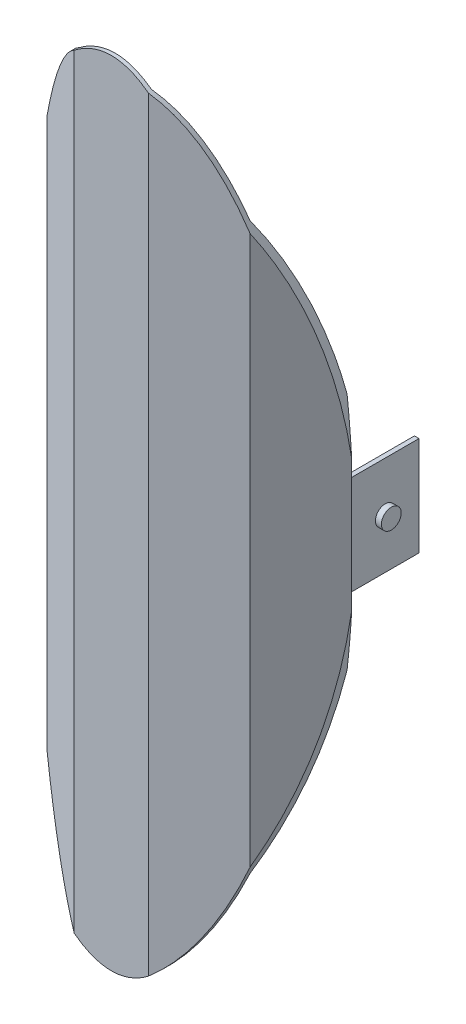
ISO-10303-21;
HEADER;
FILE_DESCRIPTION(('STEP AP214'),'2;1');
FILE_NAME('part.step','',(''),(''),'','','');
FILE_SCHEMA(('AUTOMOTIVE_DESIGN { 1 0 10303 214 1 1 1 1 }'));
ENDSEC;
DATA;
#1=APPLICATION_CONTEXT('core data for automotive mechanical design processes');
#2=APPLICATION_PROTOCOL_DEFINITION('international standard','automotive_design',2000,#1);
#3=PRODUCT_CONTEXT('',#1,'mechanical');
#4=PRODUCT('Part','Part','',(#3));
#5=PRODUCT_RELATED_PRODUCT_CATEGORY('part','',(#4));
#6=PRODUCT_DEFINITION_FORMATION('','',#4);
#7=PRODUCT_DEFINITION_CONTEXT('part definition',#1,'design');
#8=PRODUCT_DEFINITION('design','',#6,#7);
#9=PRODUCT_DEFINITION_SHAPE('','',#8);
#10=(LENGTH_UNIT() NAMED_UNIT(*) SI_UNIT(.MILLI.,.METRE.));
#11=(NAMED_UNIT(*) PLANE_ANGLE_UNIT() SI_UNIT($,.RADIAN.));
#12=(NAMED_UNIT(*) SI_UNIT($,.STERADIAN.) SOLID_ANGLE_UNIT());
#13=UNCERTAINTY_MEASURE_WITH_UNIT(LENGTH_MEASURE(1.E-05),#10,'distance_accuracy_value','');
#14=(GEOMETRIC_REPRESENTATION_CONTEXT(3) GLOBAL_UNCERTAINTY_ASSIGNED_CONTEXT((#13)) GLOBAL_UNIT_ASSIGNED_CONTEXT((#10,
#11,#12)) REPRESENTATION_CONTEXT('',''));
#15=CARTESIAN_POINT('',(0.,0.,0.));
#16=DIRECTION('',(0.,0.,1.));
#17=DIRECTION('',(1.,0.,0.));
#18=AXIS2_PLACEMENT_3D('',#15,#16,#17);
#19=CARTESIAN_POINT('',(73.,0.,1.7564434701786));
#20=DIRECTION('',(-1.,0.,0.));
#21=DIRECTION('',(0.,0.,-1.));
#22=AXIS2_PLACEMENT_3D('',#19,#20,#21);
#23=CYLINDRICAL_SURFACE('',#22,5.);
#24=CARTESIAN_POINT('',(73.,0.,1.7564434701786));
#25=DIRECTION('',(-1.,0.,0.));
#26=DIRECTION('',(0.,0.,1.));
#27=AXIS2_PLACEMENT_3D('',#24,#25,#26);
#28=CIRCLE('',#27,5.);
#29=CARTESIAN_POINT('',(73.,0.,6.7564434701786));
#30=VERTEX_POINT('',#29);
#31=EDGE_CURVE('E11',#30,#30,#28,.T.);
#32=ORIENTED_EDGE('',*,*,#31,.T.);
#33=EDGE_LOOP('',(#32));
#34=FACE_BOUND('',#33,.T.);
#35=CARTESIAN_POINT('',(70.,0.,1.7564434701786));
#36=DIRECTION('',(-1.,0.,0.));
#37=DIRECTION('',(0.,0.,1.));
#38=AXIS2_PLACEMENT_3D('',#35,#36,#37);
#39=CIRCLE('',#38,5.);
#40=CARTESIAN_POINT('',(70.,0.,6.7564434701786));
#41=VERTEX_POINT('',#40);
#42=EDGE_CURVE('E42',#41,#41,#39,.T.);
#43=ORIENTED_EDGE('',*,*,#42,.F.);
#44=EDGE_LOOP('',(#43));
#45=FACE_BOUND('',#44,.T.);
#46=ADVANCED_FACE('F39',(#34,#45),#23,.T.);
#47=CARTESIAN_POINT('',(73.,0.,1.7564434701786));
#48=DIRECTION('',(1.,0.,0.));
#49=DIRECTION('',(0.,0.,1.));
#50=AXIS2_PLACEMENT_3D('',#47,#48,#49);
#51=PLANE('',#50);
#52=ORIENTED_EDGE('',*,*,#31,.F.);
#53=EDGE_LOOP('',(#52));
#54=FACE_BOUND('',#53,.T.);
#55=ADVANCED_FACE('F54',(#54),#51,.T.);
#56=CARTESIAN_POINT('',(70.,0.,1.7564434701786));
#57=DIRECTION('',(1.,0.,0.));
#58=DIRECTION('',(0.,0.,1.));
#59=AXIS2_PLACEMENT_3D('',#56,#57,#58);
#60=PLANE('',#59);
#61=ORIENTED_EDGE('',*,*,#42,.T.);
#62=EDGE_LOOP('',(#61));
#63=FACE_BOUND('',#62,.T.);
#64=ADVANCED_FACE('F51',(#63),#60,.F.);
#65=CLOSED_SHELL('',(#46,#55,#64));
#66=MANIFOLD_SOLID_BREP('B2',#65);
#67=CARTESIAN_POINT('',(-73.,0.,1.7564434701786));
#68=DIRECTION('',(1.,0.,0.));
#69=DIRECTION('',(0.,0.,-1.));
#70=AXIS2_PLACEMENT_3D('',#67,#68,#69);
#71=CYLINDRICAL_SURFACE('',#70,5.);
#72=CARTESIAN_POINT('',(-73.,0.,1.7564434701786));
#73=DIRECTION('',(-1.,0.,0.));
#74=DIRECTION('',(0.,0.,1.));
#75=AXIS2_PLACEMENT_3D('',#72,#73,#74);
#76=CIRCLE('',#75,5.);
#77=CARTESIAN_POINT('',(-73.,0.,6.7564434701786));
#78=VERTEX_POINT('',#77);
#79=EDGE_CURVE('E38',#78,#78,#76,.T.);
#80=ORIENTED_EDGE('',*,*,#79,.F.);
#81=EDGE_LOOP('',(#80));
#82=FACE_BOUND('',#81,.T.);
#83=CARTESIAN_POINT('',(-70.,0.,1.7564434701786));
#84=DIRECTION('',(-1.,0.,0.));
#85=DIRECTION('',(0.,0.,1.));
#86=AXIS2_PLACEMENT_3D('',#83,#84,#85);
#87=CIRCLE('',#86,5.);
#88=CARTESIAN_POINT('',(-70.,0.,6.7564434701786));
#89=VERTEX_POINT('',#88);
#90=EDGE_CURVE('E91',#89,#89,#87,.T.);
#91=ORIENTED_EDGE('',*,*,#90,.T.);
#92=EDGE_LOOP('',(#91));
#93=FACE_BOUND('',#92,.T.);
#94=ADVANCED_FACE('F88',(#82,#93),#71,.T.);
#95=CARTESIAN_POINT('',(-73.,0.,1.7564434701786));
#96=DIRECTION('',(-1.,0.,0.));
#97=DIRECTION('',(0.,0.,1.));
#98=AXIS2_PLACEMENT_3D('',#95,#96,#97);
#99=PLANE('',#98);
#100=ORIENTED_EDGE('',*,*,#79,.T.);
#101=EDGE_LOOP('',(#100));
#102=FACE_BOUND('',#101,.T.);
#103=ADVANCED_FACE('F103',(#102),#99,.T.);
#104=CARTESIAN_POINT('',(-70.,0.,1.7564434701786));
#105=DIRECTION('',(-1.,0.,0.));
#106=DIRECTION('',(0.,0.,1.));
#107=AXIS2_PLACEMENT_3D('',#104,#105,#106);
#108=PLANE('',#107);
#109=ORIENTED_EDGE('',*,*,#90,.F.);
#110=EDGE_LOOP('',(#109));
#111=FACE_BOUND('',#110,.T.);
#112=ADVANCED_FACE('F101',(#111),#108,.F.);
#113=CLOSED_SHELL('',(#94,#103,#112));
#114=MANIFOLD_SOLID_BREP('B6',#113);
#115=CARTESIAN_POINT('',(70.,200.,18.7564434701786));
#116=DIRECTION('',(0.,0.,1.));
#117=DIRECTION('',(1.,0.,0.));
#118=AXIS2_PLACEMENT_3D('',#115,#116,#117);
#119=PLANE('',#118);
#120=DIRECTION('',(1.,0.,0.));
#121=VECTOR('',#120,1.);
#122=CARTESIAN_POINT('',(67.6905989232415,25.,18.7564434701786));
#123=LINE('',#122,#121);
#124=CARTESIAN_POINT('',(67.6905989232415,25.,18.7564434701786));
#125=VERTEX_POINT('',#124);
#126=CARTESIAN_POINT('',(70.,25.,18.7564434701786));
#127=VERTEX_POINT('',#126);
#128=EDGE_CURVE('E291',#125,#127,#123,.T.);
#129=ORIENTED_EDGE('',*,*,#128,.F.);
#130=DIRECTION('',(0.,-1.,0.));
#131=VECTOR('',#130,1.);
#132=CARTESIAN_POINT('',(67.6905989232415,200.,18.7564434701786));
#133=LINE('',#132,#131);
#134=CARTESIAN_POINT('',(67.6905989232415,60.3489697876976,18.7564434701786));
#135=VERTEX_POINT('',#134);
#136=EDGE_CURVE('E585',#135,#125,#133,.T.);
#137=ORIENTED_EDGE('',*,*,#136,.F.);
#138=CARTESIAN_POINT('',(0.,0.,18.7564434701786));
#139=DIRECTION('',(0.,0.,1.));
#140=DIRECTION('',(0.,1.,0.));
#141=AXIS2_PLACEMENT_3D('',#138,#139,#140);
#142=ELLIPSE('',#141,200.,71.);
#143=CARTESIAN_POINT('',(70.,33.4488509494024,18.7564434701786));
#144=VERTEX_POINT('',#143);
#145=EDGE_CURVE('E598',#135,#144,#142,.F.);
#146=ORIENTED_EDGE('',*,*,#145,.T.);
#147=DIRECTION('',(0.,-1.,0.));
#148=VECTOR('',#147,1.);
#149=CARTESIAN_POINT('',(70.,200.,18.7564434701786));
#150=LINE('',#149,#148);
#151=EDGE_CURVE('E525',#144,#127,#150,.T.);
#152=ORIENTED_EDGE('',*,*,#151,.T.);
#153=EDGE_LOOP('',(#129,#137,#146,#152));
#154=FACE_BOUND('',#153,.T.);
#155=ADVANCED_FACE('F128',(#154),#119,.F.);
#156=DIRECTION('',(-1.,0.,0.));
#157=VECTOR('',#156,1.);
#158=CARTESIAN_POINT('',(67.6905989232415,-25.,18.7564434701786));
#159=LINE('',#158,#157);
#160=CARTESIAN_POINT('',(70.,-25.,18.7564434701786));
#161=VERTEX_POINT('',#160);
#162=CARTESIAN_POINT('',(67.6905989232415,-25.,18.7564434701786));
#163=VERTEX_POINT('',#162);
#164=EDGE_CURVE('E597',#161,#163,#159,.T.);
#165=ORIENTED_EDGE('',*,*,#164,.F.);
#166=CARTESIAN_POINT('',(70.,-33.4488509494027,18.7564434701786));
#167=VERTEX_POINT('',#166);
#168=EDGE_CURVE('E588',#161,#167,#150,.T.);
#169=ORIENTED_EDGE('',*,*,#168,.T.);
#170=CARTESIAN_POINT('',(67.6905989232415,-60.3489697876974,18.7564434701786));
#171=VERTEX_POINT('',#170);
#172=EDGE_CURVE('E554',#167,#171,#142,.F.);
#173=ORIENTED_EDGE('',*,*,#172,.T.);
#174=EDGE_CURVE('E583',#163,#171,#133,.T.);
#175=ORIENTED_EDGE('',*,*,#174,.F.);
#176=EDGE_LOOP('',(#165,#169,#173,#175));
#177=FACE_BOUND('',#176,.T.);
#178=ADVANCED_FACE('F480',(#177),#119,.F.);
#179=CARTESIAN_POINT('',(-70.,200.,18.7564434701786));
#180=DIRECTION('',(0.,0.,1.));
#181=DIRECTION('',(1.,0.,0.));
#182=AXIS2_PLACEMENT_3D('',#179,#180,#181);
#183=PLANE('',#182);
#184=DIRECTION('',(-1.,0.,0.));
#185=VECTOR('',#184,1.);
#186=CARTESIAN_POINT('',(-70.,-25.,18.7564434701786));
#187=LINE('',#186,#185);
#188=CARTESIAN_POINT('',(-67.6905989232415,-25.,18.7564434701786));
#189=VERTEX_POINT('',#188);
#190=CARTESIAN_POINT('',(-70.,-25.,18.7564434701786));
#191=VERTEX_POINT('',#190);
#192=EDGE_CURVE('E296',#189,#191,#187,.T.);
#193=ORIENTED_EDGE('',*,*,#192,.F.);
#194=DIRECTION('',(0.,-1.,0.));
#195=VECTOR('',#194,1.);
#196=CARTESIAN_POINT('',(-67.6905989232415,200.,18.7564434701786));
#197=LINE('',#196,#195);
#198=CARTESIAN_POINT('',(-67.6905989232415,-60.3489697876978,18.7564434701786));
#199=VERTEX_POINT('',#198);
#200=EDGE_CURVE('E535',#189,#199,#197,.T.);
#201=ORIENTED_EDGE('',*,*,#200,.T.);
#202=CARTESIAN_POINT('',(0.,0.,18.7564434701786));
#203=DIRECTION('',(0.,0.,1.));
#204=DIRECTION('',(0.,1.,0.));
#205=AXIS2_PLACEMENT_3D('',#202,#203,#204);
#206=ELLIPSE('',#205,200.,71.);
#207=CARTESIAN_POINT('',(-70.,-33.4488509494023,18.7564434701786));
#208=VERTEX_POINT('',#207);
#209=EDGE_CURVE('E546',#199,#208,#206,.F.);
#210=ORIENTED_EDGE('',*,*,#209,.T.);
#211=DIRECTION('',(0.,-1.,0.));
#212=VECTOR('',#211,1.);
#213=CARTESIAN_POINT('',(-70.,200.,18.7564434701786));
#214=LINE('',#213,#212);
#215=EDGE_CURVE('E531',#191,#208,#214,.T.);
#216=ORIENTED_EDGE('',*,*,#215,.F.);
#217=EDGE_LOOP('',(#193,#201,#210,#216));
#218=FACE_BOUND('',#217,.T.);
#219=ADVANCED_FACE('F476',(#218),#183,.F.);
#220=DIRECTION('',(1.,0.,0.));
#221=VECTOR('',#220,1.);
#222=CARTESIAN_POINT('',(-70.,25.,18.7564434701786));
#223=LINE('',#222,#221);
#224=CARTESIAN_POINT('',(-70.,25.,18.7564434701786));
#225=VERTEX_POINT('',#224);
#226=CARTESIAN_POINT('',(-67.6905989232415,25.,18.7564434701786));
#227=VERTEX_POINT('',#226);
#228=EDGE_CURVE('E305',#225,#227,#223,.T.);
#229=ORIENTED_EDGE('',*,*,#228,.F.);
#230=CARTESIAN_POINT('',(-70.,33.4488509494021,18.7564434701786));
#231=VERTEX_POINT('',#230);
#232=EDGE_CURVE('E532',#231,#225,#214,.T.);
#233=ORIENTED_EDGE('',*,*,#232,.F.);
#234=CARTESIAN_POINT('',(-67.6905989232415,60.3489697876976,18.7564434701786));
#235=VERTEX_POINT('',#234);
#236=EDGE_CURVE('E555',#231,#235,#206,.F.);
#237=ORIENTED_EDGE('',*,*,#236,.T.);
#238=EDGE_CURVE('E138',#235,#227,#197,.T.);
#239=ORIENTED_EDGE('',*,*,#238,.T.);
#240=EDGE_LOOP('',(#229,#233,#237,#239));
#241=FACE_BOUND('',#240,.T.);
#242=ADVANCED_FACE('F479',(#241),#183,.F.);
#243=CARTESIAN_POINT('',(-18.7564434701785,200.,70.));
#244=DIRECTION('',(0.,0.,-1.));
#245=DIRECTION('',(-1.,0.,0.));
#246=AXIS2_PLACEMENT_3D('',#243,#244,#245);
#247=PLANE('',#246);
#248=DIRECTION('',(0.,-1.,0.));
#249=VECTOR('',#248,1.);
#250=CARTESIAN_POINT('',(-18.7564434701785,200.,70.));
#251=LINE('',#250,#249);
#252=CARTESIAN_POINT('',(-18.7564434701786,192.894938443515,70.));
#253=VERTEX_POINT('',#252);
#254=CARTESIAN_POINT('',(-18.7564434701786,-192.894938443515,70.));
#255=VERTEX_POINT('',#254);
#256=EDGE_CURVE('E519',#253,#255,#251,.T.);
#257=ORIENTED_EDGE('',*,*,#256,.T.);
#258=CARTESIAN_POINT('',(0.,0.,70.));
#259=DIRECTION('',(0.,0.,1.));
#260=DIRECTION('',(0.,1.,0.));
#261=AXIS2_PLACEMENT_3D('',#258,#259,#260);
#262=ELLIPSE('',#261,200.,71.);
#263=CARTESIAN_POINT('',(18.7564434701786,-192.894938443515,70.));
#264=VERTEX_POINT('',#263);
#265=EDGE_CURVE('E324',#255,#264,#262,.T.);
#266=ORIENTED_EDGE('',*,*,#265,.T.);
#267=DIRECTION('',(0.,-1.,0.));
#268=VECTOR('',#267,1.);
#269=CARTESIAN_POINT('',(18.7564434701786,200.,70.));
#270=LINE('',#269,#268);
#271=CARTESIAN_POINT('',(18.7564434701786,192.894938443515,70.));
#272=VERTEX_POINT('',#271);
#273=EDGE_CURVE('E514',#272,#264,#270,.T.);
#274=ORIENTED_EDGE('',*,*,#273,.F.);
#275=EDGE_CURVE('E560',#272,#253,#262,.T.);
#276=ORIENTED_EDGE('',*,*,#275,.T.);
#277=EDGE_LOOP('',(#257,#266,#274,#276));
#278=FACE_BOUND('',#277,.T.);
#279=ADVANCED_FACE('F469',(#278),#247,.F.);
#280=CARTESIAN_POINT('',(-18.2205450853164,200.,68.));
#281=DIRECTION('',(0.,0.,1.));
#282=DIRECTION('',(1.,0.,0.));
#283=AXIS2_PLACEMENT_3D('',#280,#281,#282);
#284=PLANE('',#283);
#285=DIRECTION('',(0.,-1.,0.));
#286=VECTOR('',#285,1.);
#287=CARTESIAN_POINT('',(18.2205450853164,200.,68.));
#288=LINE('',#287,#286);
#289=CARTESIAN_POINT('',(18.2205450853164,193.302082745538,68.));
#290=VERTEX_POINT('',#289);
#291=CARTESIAN_POINT('',(18.2205450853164,-193.302082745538,68.));
#292=VERTEX_POINT('',#291);
#293=EDGE_CURVE('E571',#290,#292,#288,.T.);
#294=ORIENTED_EDGE('',*,*,#293,.T.);
#295=CARTESIAN_POINT('',(0.,0.,68.));
#296=DIRECTION('',(0.,0.,1.));
#297=DIRECTION('',(0.,1.,0.));
#298=AXIS2_PLACEMENT_3D('',#295,#296,#297);
#299=ELLIPSE('',#298,200.,71.);
#300=CARTESIAN_POINT('',(-18.2205450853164,-193.302082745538,68.));
#301=VERTEX_POINT('',#300);
#302=EDGE_CURVE('E561',#292,#301,#299,.F.);
#303=ORIENTED_EDGE('',*,*,#302,.T.);
#304=DIRECTION('',(0.,-1.,0.));
#305=VECTOR('',#304,1.);
#306=CARTESIAN_POINT('',(-18.2205450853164,200.,68.));
#307=LINE('',#306,#305);
#308=CARTESIAN_POINT('',(-18.2205450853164,193.302082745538,68.));
#309=VERTEX_POINT('',#308);
#310=EDGE_CURVE('E569',#309,#301,#307,.T.);
#311=ORIENTED_EDGE('',*,*,#310,.F.);
#312=EDGE_CURVE('E327',#309,#290,#299,.F.);
#313=ORIENTED_EDGE('',*,*,#312,.T.);
#314=EDGE_LOOP('',(#294,#303,#311,#313));
#315=FACE_BOUND('',#314,.T.);
#316=ADVANCED_FACE('F340',(#315),#284,.F.);
#317=CARTESIAN_POINT('',(-49.7794549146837,200.,49.7794549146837));
#318=DIRECTION('',(-0.5,0.,0.866025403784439));
#319=DIRECTION('',(0.866025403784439,0.,0.5));
#320=AXIS2_PLACEMENT_3D('',#317,#318,#319);
#321=PLANE('',#320);
#322=ORIENTED_EDGE('',*,*,#310,.T.);
#323=CARTESIAN_POINT('',(-18.2205450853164,-193.302082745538,68.));
#324=CARTESIAN_POINT('',(-18.8531194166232,-192.828919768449,67.6347830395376));
#325=CARTESIAN_POINT('',(-19.4751765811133,-192.337314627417,67.2756381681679));
#326=CARTESIAN_POINT('',(-20.6971993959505,-191.321970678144,66.5701029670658));
#327=CARTESIAN_POINT('',(-21.2972116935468,-190.79830682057,66.2236857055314));
#328=CARTESIAN_POINT('',(-22.4763444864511,-189.721970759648,65.5429130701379));
#329=CARTESIAN_POINT('',(-23.055485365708,-189.169328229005,65.2085459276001));
#330=CARTESIAN_POINT('',(-24.1939441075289,-188.037767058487,64.5512564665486));
#331=CARTESIAN_POINT('',(-24.7532659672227,-187.458853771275,64.2283318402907));
#332=CARTESIAN_POINT('',(-25.8478117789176,-186.282832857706,63.5963955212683));
#333=CARTESIAN_POINT('',(-26.3832095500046,-185.685940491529,63.2872834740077));
#334=CARTESIAN_POINT('',(-27.4362123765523,-184.471087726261,62.6793320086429));
#335=CARTESIAN_POINT('',(-27.9538094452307,-183.85311811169,62.3804972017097));
#336=CARTESIAN_POINT('',(-28.9718477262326,-182.598251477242,61.7927325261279));
#337=CARTESIAN_POINT('',(-29.4722830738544,-181.961348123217,61.5038060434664));
#338=CARTESIAN_POINT('',(-30.4565429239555,-180.670655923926,60.935543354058));
#339=CARTESIAN_POINT('',(-30.9403671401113,-180.016866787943,60.6562073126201));
#340=CARTESIAN_POINT('',(-31.9003146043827,-178.682637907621,60.101981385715));
#341=CARTESIAN_POINT('',(-32.3761611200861,-178.00193299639,59.8272512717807));
#342=CARTESIAN_POINT('',(-33.3120090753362,-176.626424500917,59.2869392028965));
#343=CARTESIAN_POINT('',(-33.7720141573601,-175.931624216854,59.0213551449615));
#344=CARTESIAN_POINT('',(-34.6769601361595,-174.529153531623,58.4988843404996));
#345=CARTESIAN_POINT('',(-35.121902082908,-173.821484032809,58.2419969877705));
#346=CARTESIAN_POINT('',(-35.9974070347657,-172.394422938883,57.7365239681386));
#347=CARTESIAN_POINT('',(-36.4279704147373,-171.675031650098,57.4879380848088));
#348=CARTESIAN_POINT('',(-37.2771602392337,-170.222467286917,56.9976581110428));
#349=CARTESIAN_POINT('',(-37.6957281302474,-169.489248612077,56.7559978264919));
#350=CARTESIAN_POINT('',(-38.5196098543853,-168.012950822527,56.2803294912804));
#351=CARTESIAN_POINT('',(-38.9249236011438,-167.269871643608,56.0463214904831));
#352=CARTESIAN_POINT('',(-39.722868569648,-165.774667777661,55.5856277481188));
#353=CARTESIAN_POINT('',(-40.1154994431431,-165.022542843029,55.3589422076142));
#354=CARTESIAN_POINT('',(-40.888589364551,-163.510020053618,54.9125985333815));
#355=CARTESIAN_POINT('',(-41.269048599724,-162.749622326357,54.6929402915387));
#356=CARTESIAN_POINT('',(-42.0281281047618,-161.201149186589,54.2546855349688));
#357=CARTESIAN_POINT('',(-42.4064381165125,-160.412871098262,54.0362681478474));
#358=CARTESIAN_POINT('',(-43.1512576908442,-158.828949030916,53.6062463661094));
#359=CARTESIAN_POINT('',(-43.5177675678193,-158.033305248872,53.3946417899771));
#360=CARTESIAN_POINT('',(-44.2394745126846,-156.435183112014,52.9779640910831));
#361=CARTESIAN_POINT('',(-44.5946712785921,-155.632704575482,52.7728911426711));
#362=CARTESIAN_POINT('',(-45.2941925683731,-154.021416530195,52.3690223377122));
#363=CARTESIAN_POINT('',(-45.6385166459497,-153.212606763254,52.1702267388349));
#364=CARTESIAN_POINT('',(-46.3141473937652,-151.595228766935,51.7801511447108));
#365=CARTESIAN_POINT('',(-46.6455322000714,-150.786704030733,51.5888260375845));
#366=CARTESIAN_POINT('',(-47.298342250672,-149.164339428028,51.2119259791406));
#367=CARTESIAN_POINT('',(-47.6197677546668,-148.350499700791,51.0263508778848));
#368=CARTESIAN_POINT('',(-48.2529848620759,-146.717943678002,50.6607628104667));
#369=CARTESIAN_POINT('',(-48.564777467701,-145.8992279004,50.4807492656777));
#370=CARTESIAN_POINT('',(-49.1790223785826,-144.257336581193,50.1261148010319));
#371=CARTESIAN_POINT('',(-49.4814765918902,-143.434161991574,49.9514927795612));
#372=CARTESIAN_POINT('',(-49.7794549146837,-142.608839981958,49.7794549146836));
#373=B_SPLINE_CURVE_WITH_KNOTS('',3,(#323,#324,#325,#326,#327,#328,#329,#330,#331,#332,#333,
#334,#335,#336,#337,#338,#339,#340,#341,#342,#343,#344,#345,#346,#347,#348,#349,#350,#351,#352,
#353,#354,#355,#356,#357,#358,#359,#360,#361,#362,#363,#364,#365,#366,#367,#368,#369,#370,#371,
#372),.UNSPECIFIED.,.F.,.F.,(4,2,2,2,2,2,2,2,2,2,2,2,2,2,2,2,2,2,2,2,2,2,2,2,4),(0.,
2.61036973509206,5.21485389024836,7.81672137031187,10.418061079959,12.9955701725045,
15.5742210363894,18.1537444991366,20.7333124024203,23.3573696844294,25.9808195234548,
28.6040861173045,31.2272842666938,33.8616384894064,36.4960098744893,39.1304535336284,
41.7648566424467,44.4683917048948,47.1718546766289,49.8753897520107,52.5790356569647,
55.2624476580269,57.945789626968,60.628851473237,63.3113614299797),.UNSPECIFIED.);
#374=CARTESIAN_POINT('',(-49.7794549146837,-142.608839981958,49.7794549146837));
#375=VERTEX_POINT('',#374);
#376=EDGE_CURVE('E345',#301,#375,#373,.T.);
#377=ORIENTED_EDGE('',*,*,#376,.T.);
#378=DIRECTION('',(0.,-1.,0.));
#379=VECTOR('',#378,1.);
#380=CARTESIAN_POINT('',(-49.7794549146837,200.,49.7794549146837));
#381=LINE('',#380,#379);
#382=CARTESIAN_POINT('',(-49.7794549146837,142.608839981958,49.7794549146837));
#383=VERTEX_POINT('',#382);
#384=EDGE_CURVE('E86',#383,#375,#381,.T.);
#385=ORIENTED_EDGE('',*,*,#384,.F.);
#386=CARTESIAN_POINT('',(-49.7794549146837,142.608839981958,49.7794549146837));
#387=CARTESIAN_POINT('',(-49.399986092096,143.659847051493,49.9985413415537));
#388=CARTESIAN_POINT('',(-49.0132662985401,144.707383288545,50.2218141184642));
#389=CARTESIAN_POINT('',(-48.2237506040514,146.797172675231,50.6776412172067));
#390=CARTESIAN_POINT('',(-47.8209202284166,147.839408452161,50.9102154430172));
#391=CARTESIAN_POINT('',(-46.998653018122,149.917177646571,51.3849516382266));
#392=CARTESIAN_POINT('',(-46.5791901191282,150.952697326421,51.6271286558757));
#393=CARTESIAN_POINT('',(-45.7230600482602,153.015564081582,52.1214155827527));
#394=CARTESIAN_POINT('',(-45.2863751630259,154.042901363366,52.3735357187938));
#395=CARTESIAN_POINT('',(-44.3951438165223,156.087903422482,52.8880883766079));
#396=CARTESIAN_POINT('',(-43.9405877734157,157.105562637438,53.1505264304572));
#397=CARTESIAN_POINT('',(-43.0128780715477,159.129665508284,53.6861398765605));
#398=CARTESIAN_POINT('',(-42.5397224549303,160.13610796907,53.9593163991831));
#399=CARTESIAN_POINT('',(-41.5877456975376,162.107679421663,54.5089404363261));
#400=CARTESIAN_POINT('',(-41.1094781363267,163.073164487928,54.7850683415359));
#401=CARTESIAN_POINT('',(-40.1336983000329,164.990607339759,55.3484350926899));
#402=CARTESIAN_POINT('',(-39.6361933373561,165.942570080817,55.6356697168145));
#403=CARTESIAN_POINT('',(-38.6209340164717,167.831387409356,56.2218299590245));
#404=CARTESIAN_POINT('',(-38.103189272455,168.768248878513,56.520750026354));
#405=CARTESIAN_POINT('',(-37.0462974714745,170.625175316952,57.1309467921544));
#406=CARTESIAN_POINT('',(-36.5071598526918,171.545247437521,57.4422180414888));
#407=CARTESIAN_POINT('',(-35.4061544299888,173.366762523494,58.0778838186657));
#408=CARTESIAN_POINT('',(-34.8442922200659,174.268209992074,58.4022751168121));
#409=CARTESIAN_POINT('',(-33.6962664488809,176.050508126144,59.0650881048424));
#410=CARTESIAN_POINT('',(-33.1100992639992,176.931355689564,59.403511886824));
#411=CARTESIAN_POINT('',(-32.1732389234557,178.290657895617,59.9444084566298));
#412=CARTESIAN_POINT('',(-31.8312726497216,178.777155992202,60.141842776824));
#413=CARTESIAN_POINT('',(-31.1388816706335,179.742134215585,60.541594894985));
#414=CARTESIAN_POINT('',(-30.7884563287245,180.220613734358,60.743913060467));
#415=CARTESIAN_POINT('',(-30.0789533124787,181.168827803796,61.1535448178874));
#416=CARTESIAN_POINT('',(-29.7198768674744,181.638563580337,61.3608577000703));
#417=CARTESIAN_POINT('',(-28.9928515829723,182.568548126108,61.7806059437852));
#418=CARTESIAN_POINT('',(-28.6249053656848,183.028799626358,61.9930397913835));
#419=CARTESIAN_POINT('',(-27.8798984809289,183.939047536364,62.4231697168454));
#420=CARTESIAN_POINT('',(-27.5028412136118,184.389047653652,62.6408638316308));
#421=CARTESIAN_POINT('',(-26.7393426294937,185.277996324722,63.0816699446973));
#422=CARTESIAN_POINT('',(-26.3529047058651,185.716948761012,63.3047799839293));
#423=CARTESIAN_POINT('',(-25.5639708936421,186.590024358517,63.7602711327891));
#424=CARTESIAN_POINT('',(-25.1613168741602,187.023957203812,63.9927435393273));
#425=CARTESIAN_POINT('',(-24.3456354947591,187.878653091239,64.4636774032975));
#426=CARTESIAN_POINT('',(-23.9326079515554,188.299415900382,64.7021389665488));
#427=CARTESIAN_POINT('',(-23.0957889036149,189.12679496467,65.1852766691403));
#428=CARTESIAN_POINT('',(-22.671993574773,189.533406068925,65.4299550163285));
#429=CARTESIAN_POINT('',(-21.8132042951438,190.331437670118,65.9257772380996));
#430=CARTESIAN_POINT('',(-21.3782011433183,190.722844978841,66.1769264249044));
#431=CARTESIAN_POINT('',(-20.496502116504,191.489356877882,66.6859755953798));
#432=CARTESIAN_POINT('',(-20.0497895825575,191.864435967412,66.9438851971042));
#433=CARTESIAN_POINT('',(-19.1441349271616,192.597061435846,67.4667651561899));
#434=CARTESIAN_POINT('',(-18.6851662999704,192.954564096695,67.7317508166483));
#435=CARTESIAN_POINT('',(-18.2205450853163,193.302082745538,68.));
#436=B_SPLINE_CURVE_WITH_KNOTS('',3,(#386,#387,#388,#389,#390,#391,#392,#393,#394,#395,#396,
#397,#398,#399,#400,#401,#402,#403,#404,#405,#406,#407,#408,#409,#410,#411,#412,#413,#414,#415,
#416,#417,#418,#419,#420,#421,#422,#423,#424,#425,#426,#427,#428,#429,#430,#431,#432,#433,#434,
#435),.UNSPECIFIED.,.F.,.F.,(4,2,2,2,2,2,2,2,2,2,2,2,2,2,2,2,2,2,2,2,2,2,2,2,4),(0.,
3.41605623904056,6.83986088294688,10.2692611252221,13.702285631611,17.137176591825,
20.572430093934,23.9089615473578,27.2442369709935,30.577946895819,33.9102020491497,
37.2416418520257,40.5735801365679,42.4532101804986,44.3329821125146,46.2124884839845,
48.0914458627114,49.9697125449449,51.8473096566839,53.7550154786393,55.6627550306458,
57.5711818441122,59.481228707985,61.3941587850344,63.3116283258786),.UNSPECIFIED.);
#437=EDGE_CURVE('E410',#383,#309,#436,.T.);
#438=ORIENTED_EDGE('',*,*,#437,.T.);
#439=EDGE_LOOP('',(#322,#377,#385,#438));
#440=FACE_BOUND('',#439,.T.);
#441=ADVANCED_FACE('F130',(#440),#321,.F.);
#442=CARTESIAN_POINT('',(-67.6905989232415,200.,18.7564434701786));
#443=DIRECTION('',(-0.866025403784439,0.,0.5));
#444=DIRECTION('',(0.5,0.,0.866025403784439));
#445=AXIS2_PLACEMENT_3D('',#442,#443,#444);
#446=PLANE('',#445);
#447=ORIENTED_EDGE('',*,*,#384,.T.);
#448=CARTESIAN_POINT('',(-49.7794549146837,-142.608839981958,49.7794549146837));
#449=CARTESIAN_POINT('',(-50.1443777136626,-141.598076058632,49.147390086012));
#450=CARTESIAN_POINT('',(-50.5041113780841,-140.579832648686,48.524313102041));
#451=CARTESIAN_POINT('',(-51.2131994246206,-138.529310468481,47.2961365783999));
#452=CARTESIAN_POINT('',(-51.5625560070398,-137.497034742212,46.6910332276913));
#453=CARTESIAN_POINT('',(-52.251005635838,-135.4190570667,45.4986034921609));
#454=CARTESIAN_POINT('',(-52.5900998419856,-134.373356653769,44.911275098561));
#455=CARTESIAN_POINT('',(-53.2581321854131,-132.269117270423,43.7542091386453));
#456=CARTESIAN_POINT('',(-53.5870707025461,-131.210578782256,43.1844709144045));
#457=CARTESIAN_POINT('',(-54.2326675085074,-129.088549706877,42.0662644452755));
#458=CARTESIAN_POINT('',(-54.5493944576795,-128.025142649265,41.5176772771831));
#459=CARTESIAN_POINT('',(-55.1730189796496,-125.886793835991,40.437527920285));
#460=CARTESIAN_POINT('',(-55.4799160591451,-124.811851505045,39.9059665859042));
#461=CARTESIAN_POINT('',(-56.0839649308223,-122.650980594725,38.8597232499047));
#462=CARTESIAN_POINT('',(-56.3811161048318,-121.565051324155,38.3450423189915));
#463=CARTESIAN_POINT('',(-56.9657486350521,-119.382760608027,37.3324290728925));
#464=CARTESIAN_POINT('',(-57.2532294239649,-118.286398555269,36.8344977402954));
#465=CARTESIAN_POINT('',(-57.9931891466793,-115.403576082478,35.5528499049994));
#466=CARTESIAN_POINT('',(-58.437909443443,-113.609123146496,34.7825717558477));
#467=CARTESIAN_POINT('',(-59.3026164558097,-109.996229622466,33.2848552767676));
#468=CARTESIAN_POINT('',(-59.7225992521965,-108.177785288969,32.5574237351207));
#469=CARTESIAN_POINT('',(-60.5381781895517,-104.518704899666,31.1447995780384));
#470=CARTESIAN_POINT('',(-60.9337692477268,-102.678064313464,30.4596157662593));
#471=CARTESIAN_POINT('',(-61.7008666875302,-98.9763913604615,29.1309640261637));
#472=CARTESIAN_POINT('',(-62.0723681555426,-97.1153549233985,28.4875046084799));
#473=CARTESIAN_POINT('',(-62.7915610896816,-93.3746567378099,27.2418259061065));
#474=CARTESIAN_POINT('',(-63.1392489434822,-91.4949922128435,26.6396128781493));
#475=CARTESIAN_POINT('',(-63.8157815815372,-87.6922742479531,25.4678239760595));
#476=CARTESIAN_POINT('',(-64.1442916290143,-85.7689826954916,24.8988278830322));
#477=CARTESIAN_POINT('',(-64.7773266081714,-81.9068542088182,23.8023791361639));
#478=CARTESIAN_POINT('',(-65.081853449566,-79.9680185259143,23.2749231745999));
#479=CARTESIAN_POINT('',(-65.6671448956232,-76.0766099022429,22.2611686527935));
#480=CARTESIAN_POINT('',(-65.9479156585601,-74.1240406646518,21.7748594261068));
#481=CARTESIAN_POINT('',(-66.4859077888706,-70.2069727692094,20.8430297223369));
#482=CARTESIAN_POINT('',(-66.7431402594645,-68.2424802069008,20.3974900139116));
#483=CARTESIAN_POINT('',(-67.2342558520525,-64.3033525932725,19.5468528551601));
#484=CARTESIAN_POINT('',(-67.4681556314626,-62.3287258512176,19.1417265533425));
#485=CARTESIAN_POINT('',(-67.6905989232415,-60.3489697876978,18.7564434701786));
#486=B_SPLINE_CURVE_WITH_KNOTS('',3,(#448,#449,#450,#451,#452,#453,#454,#455,#456,#457,#458,
#459,#460,#461,#462,#463,#464,#465,#466,#467,#468,#469,#470,#471,#472,#473,#474,#475,#476,#477,
#478,#479,#480,#481,#482,#483,#484,#485),.UNSPECIFIED.,.F.,.F.,(4,2,2,2,2,2,2,2,2,2,2,2,2,2,2,2,
2,2,4),(0.,3.74008638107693,7.479373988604,11.2182374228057,14.9569608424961,18.6700858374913,
22.3833968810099,26.0969430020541,29.8107065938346,35.8182422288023,41.826727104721,
47.8364598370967,53.8474145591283,59.8592790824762,65.9558952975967,72.052025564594,
78.146570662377,84.2382259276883,90.3255007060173),.UNSPECIFIED.);
#487=EDGE_CURVE('E362',#375,#199,#486,.T.);
#488=ORIENTED_EDGE('',*,*,#487,.T.);
#489=ORIENTED_EDGE('',*,*,#200,.F.);
#490=DIRECTION('',(0.,-1.,0.));
#491=VECTOR('',#490,1.);
#492=CARTESIAN_POINT('',(-67.6905989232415,-25.,18.7564434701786));
#493=LINE('',#492,#491);
#494=EDGE_CURVE('E293',#227,#189,#493,.T.);
#495=ORIENTED_EDGE('',*,*,#494,.F.);
#496=ORIENTED_EDGE('',*,*,#238,.F.);
#497=CARTESIAN_POINT('',(-67.6905989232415,60.3489697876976,18.7564434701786));
#498=CARTESIAN_POINT('',(-67.4001381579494,62.9340145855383,19.2595362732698));
#499=CARTESIAN_POINT('',(-67.0901526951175,65.5103427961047,19.7964468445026));
#500=CARTESIAN_POINT('',(-66.4305849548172,70.6428498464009,20.938851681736));
#501=CARTESIAN_POINT('',(-66.0809995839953,73.19902709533,21.5443513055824));
#502=CARTESIAN_POINT('',(-65.3413754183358,78.2905508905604,22.8254179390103));
#503=CARTESIAN_POINT('',(-64.9512981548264,80.8258751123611,23.501051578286));
#504=CARTESIAN_POINT('',(-64.1303869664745,85.8699289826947,24.9229114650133));
#505=CARTESIAN_POINT('',(-63.6995542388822,88.3786594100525,25.6691356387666));
#506=CARTESIAN_POINT('',(-62.8366875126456,93.144079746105,27.163664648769));
#507=CARTESIAN_POINT('',(-62.4081775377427,95.4033184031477,27.905865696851));
#508=CARTESIAN_POINT('',(-61.5162765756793,99.8940971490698,29.4506834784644));
#509=CARTESIAN_POINT('',(-61.0528834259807,102.125635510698,30.2533039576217));
#510=CARTESIAN_POINT('',(-59.610032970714,108.771859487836,32.7523942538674));
#511=CARTESIAN_POINT('',(-58.5773256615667,113.141368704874,34.5410957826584));
#512=CARTESIAN_POINT('',(-57.0963998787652,118.892253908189,37.1061344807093));
#513=CARTESIAN_POINT('',(-56.7126168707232,120.341187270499,37.7708661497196));
#514=CARTESIAN_POINT('',(-55.927987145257,123.220533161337,39.1298846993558));
#515=CARTESIAN_POINT('',(-55.5271405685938,124.65094584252,39.8241713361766));
#516=CARTESIAN_POINT('',(-54.7082298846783,127.4918346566,41.2425662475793));
#517=CARTESIAN_POINT('',(-54.2901664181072,128.902311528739,41.9666734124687));
#518=CARTESIAN_POINT('',(-53.4361242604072,131.703643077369,43.445917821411));
#519=CARTESIAN_POINT('',(-53.0001255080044,133.09447330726,44.2010898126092));
#520=CARTESIAN_POINT('',(-52.110463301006,135.853444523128,45.7420299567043));
#521=CARTESIAN_POINT('',(-51.6567991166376,137.22158456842,46.5277993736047));
#522=CARTESIAN_POINT('',(-50.7315770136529,139.933750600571,48.1303310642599));
#523=CARTESIAN_POINT('',(-50.26001632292,141.277772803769,48.9470981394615));
#524=CARTESIAN_POINT('',(-49.7794549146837,142.608839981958,49.7794549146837));
#525=B_SPLINE_CURVE_WITH_KNOTS('',3,(#497,#498,#499,#500,#501,#502,#503,#504,#505,#506,#507,
#508,#509,#510,#511,#512,#513,#514,#515,#516,#517,#518,#519,#520,#521,#522,#523,#524),
.UNSPECIFIED.,.F.,.F.,(4,2,2,2,2,2,2,2,2,2,2,2,2,4),(0.,7.94832548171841,15.8972722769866,
23.8538411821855,31.8101764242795,39.0579398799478,46.3061530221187,60.7923451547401,
65.7111284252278,70.6298711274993,75.5484309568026,80.472650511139,85.3970737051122,
90.3222628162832),.UNSPECIFIED.);
#526=EDGE_CURVE('E424',#235,#383,#525,.T.);
#527=ORIENTED_EDGE('',*,*,#526,.T.);
#528=EDGE_LOOP('',(#447,#488,#489,#495,#496,#527));
#529=FACE_BOUND('',#528,.T.);
#530=ADVANCED_FACE('F474',(#529),#446,.F.);
#531=CARTESIAN_POINT('',(-70.,200.,18.7564434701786));
#532=DIRECTION('',(0.866025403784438,0.,-0.500000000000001));
#533=DIRECTION('',(-0.500000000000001,0.,-0.866025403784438));
#534=AXIS2_PLACEMENT_3D('',#531,#532,#533);
#535=PLANE('',#534);
#536=ORIENTED_EDGE('',*,*,#232,.T.);
#537=DIRECTION('',(0.,1.,0.));
#538=VECTOR('',#537,1.);
#539=CARTESIAN_POINT('',(-70.,-25.,18.7564434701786));
#540=LINE('',#539,#538);
#541=EDGE_CURVE('E313',#191,#225,#540,.T.);
#542=ORIENTED_EDGE('',*,*,#541,.F.);
#543=ORIENTED_EDGE('',*,*,#215,.T.);
#544=CARTESIAN_POINT('',(-70.,-33.4488509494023,18.7564434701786));
#545=CARTESIAN_POINT('',(-69.8550974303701,-35.854940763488,19.0074220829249));
#546=CARTESIAN_POINT('',(-69.6943551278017,-38.2572362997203,19.2858359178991));
#547=CARTESIAN_POINT('',(-69.3409203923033,-43.0528149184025,19.8980028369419));
#548=CARTESIAN_POINT('',(-69.1482226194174,-45.4460964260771,20.2317651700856));
#549=CARTESIAN_POINT('',(-68.7306418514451,-50.2215626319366,20.9550362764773));
#550=CARTESIAN_POINT('',(-68.50575689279,-52.6037466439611,21.3445484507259));
#551=CARTESIAN_POINT('',(-68.0232061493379,-57.3580058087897,22.1803508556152));
#552=CARTESIAN_POINT('',(-67.7654984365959,-59.7300639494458,22.6267137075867));
#553=CARTESIAN_POINT('',(-67.2172109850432,-64.4588150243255,23.5763754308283));
#554=CARTESIAN_POINT('',(-66.9266330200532,-66.8155087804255,24.079671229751));
#555=CARTESIAN_POINT('',(-66.3122386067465,-71.51136225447,25.1438335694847));
#556=CARTESIAN_POINT('',(-65.9884239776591,-73.8505229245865,25.7046969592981));
#557=CARTESIAN_POINT('',(-65.2495742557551,-78.9027098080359,26.9844222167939));
#558=CARTESIAN_POINT('',(-64.8283700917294,-81.6121398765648,27.713969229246));
#559=CARTESIAN_POINT('',(-63.9391903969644,-87.0004199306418,29.2540736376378));
#560=CARTESIAN_POINT('',(-63.4712105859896,-89.679267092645,30.0646384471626));
#561=CARTESIAN_POINT('',(-62.4881087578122,-94.9997167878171,31.7674207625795));
#562=CARTESIAN_POINT('',(-61.9730249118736,-97.6413475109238,32.6595721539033));
#563=CARTESIAN_POINT('',(-60.8945900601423,-102.884626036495,34.5274761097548));
#564=CARTESIAN_POINT('',(-60.3312449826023,-105.486278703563,35.5032184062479));
#565=CARTESIAN_POINT('',(-59.3421250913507,-109.825326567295,37.2164243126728));
#566=CARTESIAN_POINT('',(-58.9294917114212,-111.574748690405,37.9311262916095));
#567=CARTESIAN_POINT('',(-58.0810071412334,-115.050933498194,39.4007446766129));
#568=CARTESIAN_POINT('',(-57.6451562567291,-116.777696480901,40.1556605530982));
#569=CARTESIAN_POINT('',(-56.749954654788,-120.206573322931,41.7061952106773));
#570=CARTESIAN_POINT('',(-56.2906051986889,-121.908688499,42.50181180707));
#571=CARTESIAN_POINT('',(-55.3473078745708,-125.289077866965,44.1356506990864));
#572=CARTESIAN_POINT('',(-54.8633212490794,-126.967308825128,44.9739401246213));
#573=CARTESIAN_POINT('',(-53.8710982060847,-130.295009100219,46.6925208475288));
#574=CARTESIAN_POINT('',(-53.3628603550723,-131.944476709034,47.5728146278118));
#575=CARTESIAN_POINT('',(-52.3217436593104,-135.212515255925,49.3760816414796));
#576=CARTESIAN_POINT('',(-51.7888593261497,-136.831079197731,50.2990643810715));
#577=CARTESIAN_POINT('',(-51.2435565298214,-138.432804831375,51.2435565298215));
#578=B_SPLINE_CURVE_WITH_KNOTS('',3,(#544,#545,#546,#547,#548,#549,#550,#551,#552,#553,#554,
#555,#556,#557,#558,#559,#560,#561,#562,#563,#564,#565,#566,#567,#568,#569,#570,#571,#572,#573,
#574,#575,#576,#577),.UNSPECIFIED.,.F.,.F.,(4,2,2,2,2,2,2,2,2,2,2,2,2,2,2,2,4),(0.,
7.2702613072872,14.5417387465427,21.8136599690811,29.0949653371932,36.3758779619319,
43.6563922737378,52.1668006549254,60.677988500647,69.1823393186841,77.6856469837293,
83.4879464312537,89.2901694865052,95.0920814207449,100.903420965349,106.715104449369,
112.528088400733),.UNSPECIFIED.);
#579=CARTESIAN_POINT('',(-51.2435565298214,-138.432804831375,51.2435565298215));
#580=VERTEX_POINT('',#579);
#581=EDGE_CURVE('E378',#208,#580,#578,.T.);
#582=ORIENTED_EDGE('',*,*,#581,.T.);
#583=DIRECTION('',(0.,-1.,0.));
#584=VECTOR('',#583,1.);
#585=CARTESIAN_POINT('',(-51.2435565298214,200.,51.2435565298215));
#586=LINE('',#585,#584);
#587=CARTESIAN_POINT('',(-51.2435565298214,138.432804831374,51.2435565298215));
#588=VERTEX_POINT('',#587);
#589=EDGE_CURVE('E523',#588,#580,#586,.T.);
#590=ORIENTED_EDGE('',*,*,#589,.F.);
#591=CARTESIAN_POINT('',(-51.2435565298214,138.432804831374,51.2435565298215));
#592=CARTESIAN_POINT('',(-51.9433449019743,136.377267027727,50.0314875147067));
#593=CARTESIAN_POINT('',(-52.6226742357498,134.294080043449,48.8548545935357));
#594=CARTESIAN_POINT('',(-53.9409771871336,130.077605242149,46.5714869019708));
#595=CARTESIAN_POINT('',(-54.5799562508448,127.9443242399,45.4647426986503));
#596=CARTESIAN_POINT('',(-55.8178538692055,123.633888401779,43.3206411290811));
#597=CARTESIAN_POINT('',(-56.4168015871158,121.456767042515,42.2832332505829));
#598=CARTESIAN_POINT('',(-57.5757943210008,117.061572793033,40.2757989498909));
#599=CARTESIAN_POINT('',(-58.135837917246,114.84349841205,39.3057749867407));
#600=CARTESIAN_POINT('',(-59.7579688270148,108.136464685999,36.4961618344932));
#601=CARTESIAN_POINT('',(-60.7629660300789,103.591508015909,34.7554556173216));
#602=CARTESIAN_POINT('',(-62.1594221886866,96.6854376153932,32.3367226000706));
#603=CARTESIAN_POINT('',(-62.6064591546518,94.3682905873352,31.5624318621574));
#604=CARTESIAN_POINT('',(-63.4641484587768,89.7071511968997,30.0768704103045));
#605=CARTESIAN_POINT('',(-63.8748010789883,87.3631590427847,29.3655992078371));
#606=CARTESIAN_POINT('',(-64.9611505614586,80.846170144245,27.4839867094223));
#607=CARTESIAN_POINT('',(-65.598882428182,76.6476815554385,26.3794027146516));
#608=CARTESIAN_POINT('',(-66.7650766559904,68.1909774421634,24.3594950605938));
#609=CARTESIAN_POINT('',(-67.2935486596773,63.9327672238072,23.4441546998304));
#610=CARTESIAN_POINT('',(-68.0084826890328,57.4878140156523,22.2058526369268));
#611=CARTESIAN_POINT('',(-68.2348023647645,55.3184523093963,21.8138554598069));
#612=CARTESIAN_POINT('',(-68.6603788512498,50.9690782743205,21.0767353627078));
#613=CARTESIAN_POINT('',(-68.8596355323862,48.7890658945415,20.731612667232));
#614=CARTESIAN_POINT('',(-69.231284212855,44.4200642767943,20.0878982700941));
#615=CARTESIAN_POINT('',(-69.4036779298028,42.2310756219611,19.7893035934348));
#616=CARTESIAN_POINT('',(-69.7217948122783,37.845402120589,19.2383089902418));
#617=CARTESIAN_POINT('',(-69.8675185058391,35.6487174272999,18.9859081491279));
#618=CARTESIAN_POINT('',(-70.,33.4488509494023,18.7564434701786));
#619=B_SPLINE_CURVE_WITH_KNOTS('',3,(#591,#592,#593,#594,#595,#596,#597,#598,#599,#600,#601,
#602,#603,#604,#605,#606,#607,#608,#609,#610,#611,#612,#613,#614,#615,#616,#617,#618),
.UNSPECIFIED.,.F.,.F.,(4,2,2,2,2,2,2,2,2,2,2,2,2,4),(0.,7.4595717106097,14.9181344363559,
22.3712029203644,29.8245432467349,44.7202378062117,52.1703000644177,59.6203045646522,
72.7777490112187,85.9340317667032,92.5817019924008,99.2294040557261,105.876680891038,
112.523826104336),.UNSPECIFIED.);
#620=EDGE_CURVE('E438',#588,#231,#619,.T.);
#621=ORIENTED_EDGE('',*,*,#620,.T.);
#622=EDGE_LOOP('',(#536,#542,#543,#582,#590,#621));
#623=FACE_BOUND('',#622,.T.);
#624=ADVANCED_FACE('F467',(#623),#535,.F.);
#625=CARTESIAN_POINT('',(-51.2435565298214,200.,51.2435565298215));
#626=DIRECTION('',(0.499999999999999,0.,-0.866025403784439));
#627=DIRECTION('',(-0.866025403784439,0.,-0.499999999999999));
#628=AXIS2_PLACEMENT_3D('',#625,#626,#627);
#629=PLANE('',#628);
#630=ORIENTED_EDGE('',*,*,#589,.T.);
#631=CARTESIAN_POINT('',(-51.2435565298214,-138.432804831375,51.2435565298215));
#632=CARTESIAN_POINT('',(-50.8565192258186,-139.56958661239,51.4670126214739));
#633=CARTESIAN_POINT('',(-50.461577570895,-140.702801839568,51.6950322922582));
#634=CARTESIAN_POINT('',(-49.6541447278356,-142.964095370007,52.1612038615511));
#635=CARTESIAN_POINT('',(-49.2416130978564,-144.092154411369,52.3993791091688));
#636=CARTESIAN_POINT('',(-48.3983976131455,-146.341559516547,52.8862097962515));
#637=CARTESIAN_POINT('',(-47.9676830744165,-147.462890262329,53.1348829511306));
#638=CARTESIAN_POINT('',(-47.0874212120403,-149.6972069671,53.6431023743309));
#639=CARTESIAN_POINT('',(-46.6378529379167,-150.810181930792,53.9026607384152));
#640=CARTESIAN_POINT('',(-45.7191342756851,-153.026122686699,54.4330832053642));
#641=CARTESIAN_POINT('',(-45.249972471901,-154.129082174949,54.7039538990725));
#642=CARTESIAN_POINT('',(-44.2912257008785,-156.323279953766,55.2574866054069));
#643=CARTESIAN_POINT('',(-43.8016383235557,-157.414516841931,55.5401500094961));
#644=CARTESIAN_POINT('',(-42.8158437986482,-159.551512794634,56.1092987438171));
#645=CARTESIAN_POINT('',(-42.320266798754,-160.597659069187,56.3954202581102));
#646=CARTESIAN_POINT('',(-41.3079375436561,-162.675663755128,56.9798888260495));
#647=CARTESIAN_POINT('',(-40.7911939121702,-163.707527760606,57.2782309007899));
#648=CARTESIAN_POINT('',(-39.7353731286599,-165.755218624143,57.8878093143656));
#649=CARTESIAN_POINT('',(-39.1963074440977,-166.771053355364,58.1990390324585));
#650=CARTESIAN_POINT('',(-38.0945065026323,-168.784812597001,58.8351641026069));
#651=CARTESIAN_POINT('',(-37.5317826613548,-169.782745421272,59.1600528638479));
#652=CARTESIAN_POINT('',(-36.3811173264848,-171.758659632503,59.8243898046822));
#653=CARTESIAN_POINT('',(-35.793182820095,-172.73664643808,60.1638339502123));
#654=CARTESIAN_POINT('',(-34.590252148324,-174.670470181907,60.8583462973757));
#655=CARTESIAN_POINT('',(-33.9752519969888,-175.626303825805,61.2134168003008));
#656=CARTESIAN_POINT('',(-33.0027563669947,-177.083630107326,61.7748874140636));
#657=CARTESIAN_POINT('',(-32.6553190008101,-177.594100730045,61.9754804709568));
#658=CARTESIAN_POINT('',(-31.9515933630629,-178.606918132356,62.3817766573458));
#659=CARTESIAN_POINT('',(-31.5953044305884,-179.109264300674,62.5874801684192));
#660=CARTESIAN_POINT('',(-30.8736592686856,-180.105075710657,63.0041221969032));
#661=CARTESIAN_POINT('',(-30.5083043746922,-180.598542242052,63.2150599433));
#662=CARTESIAN_POINT('',(-29.7682815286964,-181.575820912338,63.6423123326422));
#663=CARTESIAN_POINT('',(-29.3936164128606,-182.05963591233,63.8586253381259));
#664=CARTESIAN_POINT('',(-28.634702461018,-183.016809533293,64.296784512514));
#665=CARTESIAN_POINT('',(-28.2504573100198,-183.490172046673,64.5186285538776));
#666=CARTESIAN_POINT('',(-27.4720813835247,-184.425607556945,64.9680241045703));
#667=CARTESIAN_POINT('',(-27.0779543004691,-184.887684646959,65.1955734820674));
#668=CARTESIAN_POINT('',(-26.2729714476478,-185.807109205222,65.6603305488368));
#669=CARTESIAN_POINT('',(-25.8619487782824,-186.264262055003,65.897634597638));
#670=CARTESIAN_POINT('',(-25.0289283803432,-187.165066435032,66.3785791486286));
#671=CARTESIAN_POINT('',(-24.6069304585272,-187.608717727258,66.6222197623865));
#672=CARTESIAN_POINT('',(-23.7515194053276,-188.481488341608,67.1160915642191));
#673=CARTESIAN_POINT('',(-23.3181021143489,-188.910602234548,67.3663251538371));
#674=CARTESIAN_POINT('',(-22.439361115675,-189.753192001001,67.8736665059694));
#675=CARTESIAN_POINT('',(-21.9940273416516,-190.166653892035,68.1307800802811));
#676=CARTESIAN_POINT('',(-21.0908939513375,-190.976757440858,68.6522043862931));
#677=CARTESIAN_POINT('',(-20.6330760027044,-191.373371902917,68.9165257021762));
#678=CARTESIAN_POINT('',(-19.704362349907,-192.148464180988,69.4527187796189));
#679=CARTESIAN_POINT('',(-19.2334372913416,-192.526895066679,69.7246074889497));
#680=CARTESIAN_POINT('',(-18.7564434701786,-192.894938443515,70.));
#681=B_SPLINE_CURVE_WITH_KNOTS('',3,(#631,#632,#633,#634,#635,#636,#637,#638,#639,#640,#641,
#642,#643,#644,#645,#646,#647,#648,#649,#650,#651,#652,#653,#654,#655,#656,#657,#658,#659,#660,
#661,#662,#663,#664,#665,#666,#667,#668,#669,#670,#671,#672,#673,#674,#675,#676,#677,#678,#679,
#680),.UNSPECIFIED.,.F.,.F.,(4,2,2,2,2,2,2,2,2,2,2,2,2,2,2,2,2,2,2,2,2,2,2,2,4),(0.,
3.66441818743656,7.33777105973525,11.0175920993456,14.7016165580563,18.3878182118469,
22.0744560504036,25.6514273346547,29.2269555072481,32.8006690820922,36.3726776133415,
39.9437024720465,43.5152550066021,45.4629063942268,47.410703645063,49.3582156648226,
51.3051415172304,53.2513296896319,55.1968011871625,57.1734652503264,59.1501641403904,
61.1275932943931,63.1067491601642,65.088987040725,67.0760927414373),.UNSPECIFIED.);
#682=EDGE_CURVE('E395',#580,#255,#681,.T.);
#683=ORIENTED_EDGE('',*,*,#682,.T.);
#684=ORIENTED_EDGE('',*,*,#256,.F.);
#685=CARTESIAN_POINT('',(-18.7564434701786,192.894938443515,70.));
#686=CARTESIAN_POINT('',(-19.3968418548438,192.400788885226,69.6302658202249));
#687=CARTESIAN_POINT('',(-20.0262642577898,191.887983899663,69.2668686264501));
#688=CARTESIAN_POINT('',(-21.2621653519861,190.829987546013,68.5533207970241));
#689=CARTESIAN_POINT('',(-21.868692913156,190.284872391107,68.2031419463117));
#690=CARTESIAN_POINT('',(-23.0601150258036,189.165467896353,67.5152740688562));
#691=CARTESIAN_POINT('',(-23.6450308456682,188.591208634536,67.1775727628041));
#692=CARTESIAN_POINT('',(-24.7943886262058,187.416306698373,66.5139907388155));
#693=CARTESIAN_POINT('',(-25.3588347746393,186.815669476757,66.1881076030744));
#694=CARTESIAN_POINT('',(-26.4629747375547,185.596382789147,65.5506320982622));
#695=CARTESIAN_POINT('',(-27.0028488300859,184.977950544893,65.2389356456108));
#696=CARTESIAN_POINT('',(-28.0643069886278,183.719993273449,64.6261024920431));
#697=CARTESIAN_POINT('',(-28.5858827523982,183.080458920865,64.3249705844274));
#698=CARTESIAN_POINT('',(-29.6114347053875,181.78246507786,63.7328678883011));
#699=CARTESIAN_POINT('',(-30.1154047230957,181.12399909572,63.4419006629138));
#700=CARTESIAN_POINT('',(-31.1063351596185,179.790207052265,62.8697867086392));
#701=CARTESIAN_POINT('',(-31.5932950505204,179.114880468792,62.5886402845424));
#702=CARTESIAN_POINT('',(-32.5854003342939,177.699882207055,62.0158480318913));
#703=CARTESIAN_POINT('',(-33.0893326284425,176.959077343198,61.7249025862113));
#704=CARTESIAN_POINT('',(-34.0792747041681,175.461950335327,61.153359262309));
#705=CARTESIAN_POINT('',(-34.5652883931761,174.705631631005,60.8727591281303));
#706=CARTESIAN_POINT('',(-35.5203311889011,173.178908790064,60.3213649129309));
#707=CARTESIAN_POINT('',(-35.9893612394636,172.408505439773,60.0505702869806));
#708=CARTESIAN_POINT('',(-36.9112528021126,170.854949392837,59.5183159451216));
#709=CARTESIAN_POINT('',(-37.3641147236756,170.071797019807,59.2568559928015));
#710=CARTESIAN_POINT('',(-38.256489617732,168.490272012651,58.7416431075));
#711=CARTESIAN_POINT('',(-38.6959313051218,167.691845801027,58.4879313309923));
#712=CARTESIAN_POINT('',(-39.5599789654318,166.084375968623,57.9890731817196));
#713=CARTESIAN_POINT('',(-39.98458500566,165.275332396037,57.7439267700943));
#714=CARTESIAN_POINT('',(-40.8196396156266,163.647543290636,57.2618077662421));
#715=CARTESIAN_POINT('',(-41.2300878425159,162.828797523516,57.0248353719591));
#716=CARTESIAN_POINT('',(-42.0374298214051,161.182469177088,56.5587162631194));
#717=CARTESIAN_POINT('',(-42.4343238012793,160.35488674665,56.3295694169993));
#718=CARTESIAN_POINT('',(-43.2259915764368,158.668500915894,55.8724998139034));
#719=CARTESIAN_POINT('',(-43.6204000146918,157.809468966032,55.6447879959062));
#720=CARTESIAN_POINT('',(-44.3960906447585,156.083574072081,55.1969428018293));
#721=CARTESIAN_POINT('',(-44.7773731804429,155.216711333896,54.9768092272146));
#722=CARTESIAN_POINT('',(-45.5273763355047,153.475742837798,54.5437947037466));
#723=CARTESIAN_POINT('',(-45.8960965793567,152.601636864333,54.330913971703));
#724=CARTESIAN_POINT('',(-46.6214829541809,150.84673815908,53.9121119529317));
#725=CARTESIAN_POINT('',(-46.9781485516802,149.965945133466,53.7061909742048));
#726=CARTESIAN_POINT('',(-47.6770015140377,148.205465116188,53.3027080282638));
#727=CARTESIAN_POINT('',(-48.0192835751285,147.325828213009,53.1050913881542));
#728=CARTESIAN_POINT('',(-48.6928493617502,145.560990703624,52.7162079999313));
#729=CARTESIAN_POINT('',(-49.024133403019,144.675790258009,52.5249410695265));
#730=CARTESIAN_POINT('',(-49.6760740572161,142.900307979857,52.1485429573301));
#731=CARTESIAN_POINT('',(-49.9967318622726,142.010026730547,51.963411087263));
#732=CARTESIAN_POINT('',(-50.6277532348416,140.224840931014,51.5990907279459));
#733=CARTESIAN_POINT('',(-50.9381190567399,139.329937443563,51.4199009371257));
#734=CARTESIAN_POINT('',(-51.2435565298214,138.432804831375,51.2435565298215));
#735=B_SPLINE_CURVE_WITH_KNOTS('',3,(#685,#686,#687,#688,#689,#690,#691,#692,#693,#694,#695,
#696,#697,#698,#699,#700,#701,#702,#703,#704,#705,#706,#707,#708,#709,#710,#711,#712,#713,#714,
#715,#716,#717,#718,#719,#720,#721,#722,#723,#724,#725,#726,#727,#728,#729,#730,#731,#732,#733,
#734),.UNSPECIFIED.,.F.,.F.,(4,2,2,2,2,2,2,2,2,2,2,2,2,2,2,2,2,2,2,2,2,2,2,2,4),(0.,
2.66760395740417,5.3291483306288,7.9879996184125,10.6463038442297,13.2800903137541,
15.9150567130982,18.5509376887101,21.1869003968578,24.0125536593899,26.8375870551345,
29.6624632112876,32.4872677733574,35.3251143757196,38.1629481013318,41.0008505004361,
43.838705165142,46.7554146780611,49.6720477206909,52.5887678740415,55.5056169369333,
58.3985623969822,61.2914247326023,64.1839614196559,67.0758602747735),.UNSPECIFIED.);
#736=EDGE_CURVE('E450',#253,#588,#735,.T.);
#737=ORIENTED_EDGE('',*,*,#736,.T.);
#738=EDGE_LOOP('',(#630,#683,#684,#737));
#739=FACE_BOUND('',#738,.T.);
#740=ADVANCED_FACE('F462',(#739),#629,.F.);
#741=CARTESIAN_POINT('',(18.7564434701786,200.,70.));
#742=DIRECTION('',(-0.5,0.,-0.866025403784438));
#743=DIRECTION('',(-0.866025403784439,0.,0.5));
#744=AXIS2_PLACEMENT_3D('',#741,#742,#743);
#745=PLANE('',#744);
#746=ORIENTED_EDGE('',*,*,#273,.T.);
#747=CARTESIAN_POINT('',(18.7564434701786,-192.894938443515,70.));
#748=CARTESIAN_POINT('',(19.3968418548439,-192.400788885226,69.6302658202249));
#749=CARTESIAN_POINT('',(20.0262642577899,-191.887983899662,69.26686862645));
#750=CARTESIAN_POINT('',(21.2621653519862,-190.829987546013,68.5533207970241));
#751=CARTESIAN_POINT('',(21.8686929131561,-190.284872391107,68.2031419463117));
#752=CARTESIAN_POINT('',(23.0601150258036,-189.165467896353,67.5152740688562));
#753=CARTESIAN_POINT('',(23.6450308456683,-188.591208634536,67.1775727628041));
#754=CARTESIAN_POINT('',(24.7943886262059,-187.416306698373,66.5139907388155));
#755=CARTESIAN_POINT('',(25.3588347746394,-186.815669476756,66.1881076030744));
#756=CARTESIAN_POINT('',(26.4629747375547,-185.596382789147,65.5506320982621));
#757=CARTESIAN_POINT('',(27.002848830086,-184.977950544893,65.2389356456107));
#758=CARTESIAN_POINT('',(28.0643069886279,-183.719993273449,64.626102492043));
#759=CARTESIAN_POINT('',(28.5858827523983,-183.080458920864,64.3249705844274));
#760=CARTESIAN_POINT('',(29.6114347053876,-181.78246507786,63.732867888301));
#761=CARTESIAN_POINT('',(30.1154047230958,-181.123999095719,63.4419006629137));
#762=CARTESIAN_POINT('',(31.1063351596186,-179.790207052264,62.8697867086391));
#763=CARTESIAN_POINT('',(31.5932950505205,-179.114880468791,62.5886402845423));
#764=CARTESIAN_POINT('',(32.585400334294,-177.699882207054,62.0158480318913));
#765=CARTESIAN_POINT('',(33.0893326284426,-176.959077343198,61.7249025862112));
#766=CARTESIAN_POINT('',(34.0792747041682,-175.461950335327,61.1533592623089));
#767=CARTESIAN_POINT('',(34.5652883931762,-174.705631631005,60.8727591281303));
#768=CARTESIAN_POINT('',(35.5203311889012,-173.178908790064,60.3213649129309));
#769=CARTESIAN_POINT('',(35.9893612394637,-172.408505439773,60.0505702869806));
#770=CARTESIAN_POINT('',(36.9112528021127,-170.854949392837,59.5183159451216));
#771=CARTESIAN_POINT('',(37.3641147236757,-170.071797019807,59.2568559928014));
#772=CARTESIAN_POINT('',(38.2564896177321,-168.490272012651,58.7416431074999));
#773=CARTESIAN_POINT('',(38.6959313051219,-167.691845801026,58.4879313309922));
#774=CARTESIAN_POINT('',(39.5599789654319,-166.084375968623,57.9890731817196));
#775=CARTESIAN_POINT('',(39.9845850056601,-165.275332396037,57.7439267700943));
#776=CARTESIAN_POINT('',(40.8196396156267,-163.647543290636,57.261807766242));
#777=CARTESIAN_POINT('',(41.230087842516,-162.828797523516,57.0248353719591));
#778=CARTESIAN_POINT('',(42.0374298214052,-161.182469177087,56.5587162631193));
#779=CARTESIAN_POINT('',(42.4343238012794,-160.354886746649,56.3295694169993));
#780=CARTESIAN_POINT('',(43.2259915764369,-158.668500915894,55.8724998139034));
#781=CARTESIAN_POINT('',(43.620400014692,-157.809468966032,55.6447879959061));
#782=CARTESIAN_POINT('',(44.3960906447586,-156.083574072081,55.1969428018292));
#783=CARTESIAN_POINT('',(44.777373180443,-155.216711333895,54.9768092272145));
#784=CARTESIAN_POINT('',(45.5273763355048,-153.475742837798,54.5437947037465));
#785=CARTESIAN_POINT('',(45.8960965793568,-152.601636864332,54.3309139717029));
#786=CARTESIAN_POINT('',(46.621482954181,-150.846738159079,53.9121119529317));
#787=CARTESIAN_POINT('',(46.9781485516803,-149.965945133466,53.7061909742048));
#788=CARTESIAN_POINT('',(47.6770015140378,-148.205465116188,53.3027080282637));
#789=CARTESIAN_POINT('',(48.0192835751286,-147.325828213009,53.1050913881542));
#790=CARTESIAN_POINT('',(48.6928493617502,-145.560990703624,52.7162079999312));
#791=CARTESIAN_POINT('',(49.024133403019,-144.675790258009,52.5249410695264));
#792=CARTESIAN_POINT('',(49.6760740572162,-142.900307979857,52.1485429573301));
#793=CARTESIAN_POINT('',(49.9967318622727,-142.010026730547,51.9634110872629));
#794=CARTESIAN_POINT('',(50.6277532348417,-140.224840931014,51.5990907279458));
#795=CARTESIAN_POINT('',(50.9381190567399,-139.329937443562,51.4199009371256));
#796=CARTESIAN_POINT('',(51.2435565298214,-138.432804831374,51.2435565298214));
#797=B_SPLINE_CURVE_WITH_KNOTS('',3,(#747,#748,#749,#750,#751,#752,#753,#754,#755,#756,#757,
#758,#759,#760,#761,#762,#763,#764,#765,#766,#767,#768,#769,#770,#771,#772,#773,#774,#775,#776,
#777,#778,#779,#780,#781,#782,#783,#784,#785,#786,#787,#788,#789,#790,#791,#792,#793,#794,#795,
#796),.UNSPECIFIED.,.F.,.F.,(4,2,2,2,2,2,2,2,2,2,2,2,2,2,2,2,2,2,2,2,2,2,2,2,4),(0.,
2.66760395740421,5.32914833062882,7.98799961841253,10.6463038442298,13.2800903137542,
15.9150567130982,18.5509376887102,21.1869003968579,24.01255365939,26.8375870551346,
29.6624632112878,32.4872677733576,35.3251143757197,38.1629481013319,41.0008505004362,
43.8387051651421,46.7554146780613,49.6720477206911,52.5887678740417,55.5056169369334,
58.3985623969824,61.2914247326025,64.183961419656,67.0758602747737),.UNSPECIFIED.);
#798=CARTESIAN_POINT('',(51.2435565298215,-138.432804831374,51.2435565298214));
#799=VERTEX_POINT('',#798);
#800=EDGE_CURVE('E354',#264,#799,#797,.T.);
#801=ORIENTED_EDGE('',*,*,#800,.T.);
#802=DIRECTION('',(0.,-1.,0.));
#803=VECTOR('',#802,1.);
#804=CARTESIAN_POINT('',(51.2435565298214,200.,51.2435565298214));
#805=LINE('',#804,#803);
#806=CARTESIAN_POINT('',(51.2435565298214,138.432804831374,51.2435565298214));
#807=VERTEX_POINT('',#806);
#808=EDGE_CURVE('E520',#807,#799,#805,.T.);
#809=ORIENTED_EDGE('',*,*,#808,.F.);
#810=CARTESIAN_POINT('',(51.2435565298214,138.432804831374,51.2435565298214));
#811=CARTESIAN_POINT('',(50.8565192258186,139.56958661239,51.4670126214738));
#812=CARTESIAN_POINT('',(50.4615775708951,140.702801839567,51.6950322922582));
#813=CARTESIAN_POINT('',(49.6541447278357,142.964095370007,52.1612038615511));
#814=CARTESIAN_POINT('',(49.2416130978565,144.092154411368,52.3993791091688));
#815=CARTESIAN_POINT('',(48.3983976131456,146.341559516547,52.8862097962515));
#816=CARTESIAN_POINT('',(47.9676830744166,147.462890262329,53.1348829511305));
#817=CARTESIAN_POINT('',(47.0874212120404,149.6972069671,53.6431023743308));
#818=CARTESIAN_POINT('',(46.6378529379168,150.810181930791,53.9026607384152));
#819=CARTESIAN_POINT('',(45.7191342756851,153.026122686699,54.4330832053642));
#820=CARTESIAN_POINT('',(45.249972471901,154.129082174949,54.7039538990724));
#821=CARTESIAN_POINT('',(44.2912257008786,156.323279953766,55.2574866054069));
#822=CARTESIAN_POINT('',(43.8016383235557,157.414516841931,55.5401500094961));
#823=CARTESIAN_POINT('',(42.8158437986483,159.551512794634,56.1092987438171));
#824=CARTESIAN_POINT('',(42.3202667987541,160.597659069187,56.3954202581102));
#825=CARTESIAN_POINT('',(41.3079375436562,162.675663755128,56.9798888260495));
#826=CARTESIAN_POINT('',(40.7911939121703,163.707527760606,57.2782309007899));
#827=CARTESIAN_POINT('',(39.7353731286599,165.755218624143,57.8878093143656));
#828=CARTESIAN_POINT('',(39.1963074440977,166.771053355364,58.1990390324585));
#829=CARTESIAN_POINT('',(38.0945065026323,168.784812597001,58.8351641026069));
#830=CARTESIAN_POINT('',(37.5317826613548,169.782745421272,59.1600528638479));
#831=CARTESIAN_POINT('',(36.3811173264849,171.758659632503,59.8243898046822));
#832=CARTESIAN_POINT('',(35.793182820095,172.73664643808,60.1638339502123));
#833=CARTESIAN_POINT('',(34.590252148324,174.670470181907,60.8583462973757));
#834=CARTESIAN_POINT('',(33.9752519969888,175.626303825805,61.2134168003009));
#835=CARTESIAN_POINT('',(33.0027563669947,177.083630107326,61.7748874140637));
#836=CARTESIAN_POINT('',(32.6553190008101,177.594100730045,61.9754804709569));
#837=CARTESIAN_POINT('',(31.9515933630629,178.606918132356,62.3817766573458));
#838=CARTESIAN_POINT('',(31.5953044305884,179.109264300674,62.5874801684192));
#839=CARTESIAN_POINT('',(30.8736592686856,180.105075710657,63.0041221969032));
#840=CARTESIAN_POINT('',(30.5083043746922,180.598542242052,63.2150599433));
#841=CARTESIAN_POINT('',(29.7682815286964,181.575820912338,63.6423123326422));
#842=CARTESIAN_POINT('',(29.3936164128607,182.05963591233,63.8586253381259));
#843=CARTESIAN_POINT('',(28.634702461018,183.016809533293,64.2967845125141));
#844=CARTESIAN_POINT('',(28.2504573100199,183.490172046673,64.5186285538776));
#845=CARTESIAN_POINT('',(27.4720813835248,184.425607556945,64.9680241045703));
#846=CARTESIAN_POINT('',(27.0779543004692,184.887684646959,65.1955734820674));
#847=CARTESIAN_POINT('',(26.2729714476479,185.807109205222,65.6603305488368));
#848=CARTESIAN_POINT('',(25.8619487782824,186.264262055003,65.897634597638));
#849=CARTESIAN_POINT('',(25.0289283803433,187.165066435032,66.3785791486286));
#850=CARTESIAN_POINT('',(24.6069304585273,187.608717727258,66.6222197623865));
#851=CARTESIAN_POINT('',(23.7515194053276,188.481488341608,67.1160915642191));
#852=CARTESIAN_POINT('',(23.318102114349,188.910602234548,67.3663251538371));
#853=CARTESIAN_POINT('',(22.4393611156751,189.753192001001,67.8736665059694));
#854=CARTESIAN_POINT('',(21.9940273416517,190.166653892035,68.1307800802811));
#855=CARTESIAN_POINT('',(21.0908939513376,190.976757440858,68.652204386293));
#856=CARTESIAN_POINT('',(20.6330760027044,191.373371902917,68.9165257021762));
#857=CARTESIAN_POINT('',(19.7043623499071,192.148464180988,69.4527187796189));
#858=CARTESIAN_POINT('',(19.2334372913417,192.526895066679,69.7246074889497));
#859=CARTESIAN_POINT('',(18.7564434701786,192.894938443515,70.));
#860=B_SPLINE_CURVE_WITH_KNOTS('',3,(#810,#811,#812,#813,#814,#815,#816,#817,#818,#819,#820,
#821,#822,#823,#824,#825,#826,#827,#828,#829,#830,#831,#832,#833,#834,#835,#836,#837,#838,#839,
#840,#841,#842,#843,#844,#845,#846,#847,#848,#849,#850,#851,#852,#853,#854,#855,#856,#857,#858,
#859),.UNSPECIFIED.,.F.,.F.,(4,2,2,2,2,2,2,2,2,2,2,2,2,2,2,2,2,2,2,2,2,2,2,2,4),(0.,
3.66441818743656,7.33777105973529,11.0175920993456,14.7016165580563,18.3878182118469,
22.0744560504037,25.6514273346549,29.2269555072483,32.8006690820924,36.3726776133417,
39.9437024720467,43.5152550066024,45.4629063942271,47.4107036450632,49.3582156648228,
51.3051415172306,53.2513296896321,55.1968011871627,57.1734652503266,59.1501641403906,
61.1275932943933,63.1067491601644,65.0889870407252,67.0760927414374),.UNSPECIFIED.);
#861=EDGE_CURVE('E417',#807,#272,#860,.T.);
#862=ORIENTED_EDGE('',*,*,#861,.T.);
#863=EDGE_LOOP('',(#746,#801,#809,#862));
#864=FACE_BOUND('',#863,.T.);
#865=ADVANCED_FACE('F466',(#864),#745,.F.);
#866=CARTESIAN_POINT('',(51.2435565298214,200.,51.2435565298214));
#867=DIRECTION('',(-0.866025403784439,0.,-0.5));
#868=DIRECTION('',(-0.5,0.,0.866025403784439));
#869=AXIS2_PLACEMENT_3D('',#866,#867,#868);
#870=PLANE('',#869);
#871=ORIENTED_EDGE('',*,*,#808,.T.);
#872=CARTESIAN_POINT('',(51.2435565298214,-138.432804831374,51.2435565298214));
#873=CARTESIAN_POINT('',(51.7102441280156,-137.062004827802,50.4352298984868));
#874=CARTESIAN_POINT('',(52.1678366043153,-135.678859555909,49.6426564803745));
#875=CARTESIAN_POINT('',(53.0649510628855,-132.889614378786,48.0888086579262));
#876=CARTESIAN_POINT('',(53.504475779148,-131.483517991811,47.3275295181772));
#877=CARTESIAN_POINT('',(54.365698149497,-128.649748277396,45.8358486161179));
#878=CARTESIAN_POINT('',(54.7873965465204,-127.22207585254,45.105445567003));
#879=CARTESIAN_POINT('',(55.6126151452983,-124.34847068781,43.676125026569));
#880=CARTESIAN_POINT('',(56.0161593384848,-122.902565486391,42.9771659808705));
#881=CARTESIAN_POINT('',(56.8058952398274,-119.991837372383,41.6093032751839));
#882=CARTESIAN_POINT('',(57.1920862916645,-118.527013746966,40.9404007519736));
#883=CARTESIAN_POINT('',(57.9472770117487,-115.579814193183,39.6323720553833));
#884=CARTESIAN_POINT('',(58.3162764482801,-114.097438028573,38.9932462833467));
#885=CARTESIAN_POINT('',(59.7575566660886,-108.138169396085,36.4968757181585));
#886=CARTESIAN_POINT('',(60.7622649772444,-103.594674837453,34.7566698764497));
#887=CARTESIAN_POINT('',(62.1586316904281,-96.6894969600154,32.3380917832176));
#888=CARTESIAN_POINT('',(62.605825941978,-94.3716478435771,31.5635286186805));
#889=CARTESIAN_POINT('',(63.4638421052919,-89.7088999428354,30.0774010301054));
#890=CARTESIAN_POINT('',(63.8746622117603,-87.363999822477,29.3658397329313));
#891=CARTESIAN_POINT('',(64.7325102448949,-82.2177697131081,27.8800033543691));
#892=CARTESIAN_POINT('',(65.1723480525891,-79.4116464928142,27.1181819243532));
#893=CARTESIAN_POINT('',(66.0026385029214,-73.7698592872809,25.6800766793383));
#894=CARTESIAN_POINT('',(66.3930829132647,-70.9341904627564,25.0038071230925));
#895=CARTESIAN_POINT('',(67.1252860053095,-65.2374330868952,23.7355941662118));
#896=CARTESIAN_POINT('',(67.4670380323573,-62.3763411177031,23.1436622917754));
#897=CARTESIAN_POINT('',(68.102148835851,-56.6355122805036,22.0436181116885));
#898=CARTESIAN_POINT('',(68.3955514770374,-53.755794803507,21.5354298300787));
#899=CARTESIAN_POINT('',(68.9348629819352,-47.9790970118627,20.6013149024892));
#900=CARTESIAN_POINT('',(69.1807789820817,-45.0821193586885,20.1753758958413));
#901=CARTESIAN_POINT('',(69.6255350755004,-39.2748919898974,19.4050357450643));
#902=CARTESIAN_POINT('',(69.8243934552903,-36.3646478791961,19.0606029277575));
#903=CARTESIAN_POINT('',(70.,-33.4488509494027,18.7564434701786));
#904=B_SPLINE_CURVE_WITH_KNOTS('',3,(#872,#873,#874,#875,#876,#877,#878,#879,#880,#881,#882,
#883,#884,#885,#886,#887,#888,#889,#890,#891,#892,#893,#894,#895,#896,#897,#898,#899,#900,#901,
#902,#903),.UNSPECIFIED.,.F.,.F.,(4,2,2,2,2,2,2,2,2,2,2,2,2,2,2,4),(0.,4.97499721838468,
9.94923883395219,14.9232729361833,19.8905280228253,24.8579708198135,29.8254805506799,
44.7160220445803,52.1684481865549,59.6212439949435,68.4416939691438,77.2636120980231,
86.0867347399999,94.9018080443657,103.715555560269,112.52587242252),.UNSPECIFIED.);
#905=EDGE_CURVE('E369',#799,#167,#904,.T.);
#906=ORIENTED_EDGE('',*,*,#905,.T.);
#907=ORIENTED_EDGE('',*,*,#168,.F.);
#908=DIRECTION('',(0.,-1.,0.));
#909=VECTOR('',#908,1.);
#910=CARTESIAN_POINT('',(70.,-25.,18.7564434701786));
#911=LINE('',#910,#909);
#912=EDGE_CURVE('E621',#127,#161,#911,.T.);
#913=ORIENTED_EDGE('',*,*,#912,.F.);
#914=ORIENTED_EDGE('',*,*,#151,.F.);
#915=CARTESIAN_POINT('',(70.,33.4488509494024,18.7564434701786));
#916=CARTESIAN_POINT('',(69.8550974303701,35.8549407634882,19.0074220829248));
#917=CARTESIAN_POINT('',(69.6943551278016,38.2572362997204,19.285835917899));
#918=CARTESIAN_POINT('',(69.3409203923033,43.0528149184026,19.8980028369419));
#919=CARTESIAN_POINT('',(69.1482226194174,45.4460964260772,20.2317651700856));
#920=CARTESIAN_POINT('',(68.7306418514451,50.2215626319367,20.9550362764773));
#921=CARTESIAN_POINT('',(68.50575689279,52.6037466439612,21.3445484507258));
#922=CARTESIAN_POINT('',(68.0232061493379,57.3580058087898,22.1803508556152));
#923=CARTESIAN_POINT('',(67.7654984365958,59.7300639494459,22.6267137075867));
#924=CARTESIAN_POINT('',(67.2172109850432,64.4588150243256,23.5763754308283));
#925=CARTESIAN_POINT('',(66.9266330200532,66.8155087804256,24.079671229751));
#926=CARTESIAN_POINT('',(66.3122386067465,71.5113622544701,25.1438335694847));
#927=CARTESIAN_POINT('',(65.9884239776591,73.8505229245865,25.7046969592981));
#928=CARTESIAN_POINT('',(65.2495742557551,78.9027098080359,26.9844222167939));
#929=CARTESIAN_POINT('',(64.8283700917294,81.6121398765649,27.713969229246));
#930=CARTESIAN_POINT('',(63.9391903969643,87.0004199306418,29.2540736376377));
#931=CARTESIAN_POINT('',(63.4712105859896,89.679267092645,30.0646384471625));
#932=CARTESIAN_POINT('',(62.4881087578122,94.9997167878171,31.7674207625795));
#933=CARTESIAN_POINT('',(61.9730249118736,97.6413475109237,32.6595721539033));
#934=CARTESIAN_POINT('',(60.8945900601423,102.884626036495,34.5274761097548));
#935=CARTESIAN_POINT('',(60.3312449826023,105.486278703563,35.5032184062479));
#936=CARTESIAN_POINT('',(59.3421250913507,109.825326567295,37.2164243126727));
#937=CARTESIAN_POINT('',(58.9294917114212,111.574748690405,37.9311262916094));
#938=CARTESIAN_POINT('',(58.0810071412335,115.050933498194,39.4007446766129));
#939=CARTESIAN_POINT('',(57.6451562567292,116.777696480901,40.1556605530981));
#940=CARTESIAN_POINT('',(56.7499546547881,120.206573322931,41.7061952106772));
#941=CARTESIAN_POINT('',(56.290605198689,121.908688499,42.50181180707));
#942=CARTESIAN_POINT('',(55.3473078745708,125.289077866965,44.1356506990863));
#943=CARTESIAN_POINT('',(54.8633212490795,126.967308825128,44.9739401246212));
#944=CARTESIAN_POINT('',(53.8710982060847,130.295009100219,46.6925208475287));
#945=CARTESIAN_POINT('',(53.3628603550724,131.944476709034,47.5728146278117));
#946=CARTESIAN_POINT('',(52.3217436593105,135.212515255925,49.3760816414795));
#947=CARTESIAN_POINT('',(51.7888593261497,136.831079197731,50.2990643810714));
#948=CARTESIAN_POINT('',(51.2435565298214,138.432804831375,51.2435565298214));
#949=B_SPLINE_CURVE_WITH_KNOTS('',3,(#915,#916,#917,#918,#919,#920,#921,#922,#923,#924,#925,
#926,#927,#928,#929,#930,#931,#932,#933,#934,#935,#936,#937,#938,#939,#940,#941,#942,#943,#944,
#945,#946,#947,#948),.UNSPECIFIED.,.F.,.F.,(4,2,2,2,2,2,2,2,2,2,2,2,2,2,2,2,4),(0.,
7.2702613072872,14.5417387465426,21.813659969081,29.0949653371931,36.3758779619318,
43.6563922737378,52.1668006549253,60.6779885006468,69.1823393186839,77.685646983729,
83.4879464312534,89.2901694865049,95.0920814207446,100.903420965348,106.715104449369,
112.528088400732),.UNSPECIFIED.);
#950=EDGE_CURVE('E431',#144,#807,#949,.T.);
#951=ORIENTED_EDGE('',*,*,#950,.T.);
#952=EDGE_LOOP('',(#871,#906,#907,#913,#914,#951));
#953=FACE_BOUND('',#952,.T.);
#954=ADVANCED_FACE('F499',(#953),#870,.F.);
#955=CARTESIAN_POINT('',(49.7794549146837,200.,49.7794549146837));
#956=DIRECTION('',(0.866025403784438,0.,0.5));
#957=DIRECTION('',(0.5,0.,-0.866025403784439));
#958=AXIS2_PLACEMENT_3D('',#955,#956,#957);
#959=PLANE('',#958);
#960=ORIENTED_EDGE('',*,*,#136,.T.);
#961=DIRECTION('',(0.,1.,0.));
#962=VECTOR('',#961,1.);
#963=CARTESIAN_POINT('',(67.6905989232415,-25.,18.7564434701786));
#964=LINE('',#963,#962);
#965=EDGE_CURVE('E287',#163,#125,#964,.T.);
#966=ORIENTED_EDGE('',*,*,#965,.F.);
#967=ORIENTED_EDGE('',*,*,#174,.T.);
#968=CARTESIAN_POINT('',(67.6905989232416,-60.3489697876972,18.7564434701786));
#969=CARTESIAN_POINT('',(67.4001381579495,-62.9340145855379,19.2595362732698));
#970=CARTESIAN_POINT('',(67.0901526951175,-65.5103427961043,19.7964468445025));
#971=CARTESIAN_POINT('',(66.4305849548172,-70.6428498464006,20.9388516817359));
#972=CARTESIAN_POINT('',(66.0809995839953,-73.1990270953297,21.5443513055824));
#973=CARTESIAN_POINT('',(65.3413754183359,-78.2905508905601,22.8254179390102));
#974=CARTESIAN_POINT('',(64.9512981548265,-80.8258751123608,23.5010515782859));
#975=CARTESIAN_POINT('',(64.1303869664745,-85.8699289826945,24.9229114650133));
#976=CARTESIAN_POINT('',(63.6995542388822,-88.3786594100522,25.6691356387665));
#977=CARTESIAN_POINT('',(62.8366875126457,-93.1440797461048,27.1636646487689));
#978=CARTESIAN_POINT('',(62.4081775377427,-95.4033184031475,27.9058656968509));
#979=CARTESIAN_POINT('',(61.5162765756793,-99.8940971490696,29.4506834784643));
#980=CARTESIAN_POINT('',(61.0528834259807,-102.125635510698,30.2533039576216));
#981=CARTESIAN_POINT('',(59.6100329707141,-108.771859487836,32.7523942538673));
#982=CARTESIAN_POINT('',(58.5773256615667,-113.141368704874,34.5410957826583));
#983=CARTESIAN_POINT('',(57.0963998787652,-118.892253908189,37.1061344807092));
#984=CARTESIAN_POINT('',(56.7126168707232,-120.341187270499,37.7708661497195));
#985=CARTESIAN_POINT('',(55.9279871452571,-123.220533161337,39.1298846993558));
#986=CARTESIAN_POINT('',(55.5271405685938,-124.65094584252,39.8241713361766));
#987=CARTESIAN_POINT('',(54.7082298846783,-127.4918346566,41.2425662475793));
#988=CARTESIAN_POINT('',(54.2901664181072,-128.902311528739,41.9666734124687));
#989=CARTESIAN_POINT('',(53.4361242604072,-131.703643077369,43.4459178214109));
#990=CARTESIAN_POINT('',(53.0001255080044,-133.09447330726,44.2010898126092));
#991=CARTESIAN_POINT('',(52.110463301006,-135.853444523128,45.7420299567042));
#992=CARTESIAN_POINT('',(51.6567991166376,-137.22158456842,46.5277993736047));
#993=CARTESIAN_POINT('',(50.7315770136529,-139.933750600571,48.1303310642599));
#994=CARTESIAN_POINT('',(50.26001632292,-141.277772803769,48.9470981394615));
#995=CARTESIAN_POINT('',(49.7794549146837,-142.608839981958,49.7794549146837));
#996=B_SPLINE_CURVE_WITH_KNOTS('',3,(#968,#969,#970,#971,#972,#973,#974,#975,#976,#977,#978,
#979,#980,#981,#982,#983,#984,#985,#986,#987,#988,#989,#990,#991,#992,#993,#994,#995),
.UNSPECIFIED.,.F.,.F.,(4,2,2,2,2,2,2,2,2,2,2,2,2,4),(0.,7.94832548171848,15.8972722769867,
23.8538411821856,31.8101764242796,39.057939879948,46.306153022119,60.7923451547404,
65.7111284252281,70.6298711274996,75.548430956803,80.4726505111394,85.3970737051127,
90.3222628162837),.UNSPECIFIED.);
#997=CARTESIAN_POINT('',(49.7794549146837,-142.608839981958,49.7794549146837));
#998=VERTEX_POINT('',#997);
#999=EDGE_CURVE('E387',#171,#998,#996,.T.);
#1000=ORIENTED_EDGE('',*,*,#999,.T.);
#1001=DIRECTION('',(0.,-1.,0.));
#1002=VECTOR('',#1001,1.);
#1003=CARTESIAN_POINT('',(49.7794549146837,200.,49.7794549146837));
#1004=LINE('',#1003,#1002);
#1005=CARTESIAN_POINT('',(49.7794549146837,142.608839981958,49.7794549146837));
#1006=VERTEX_POINT('',#1005);
#1007=EDGE_CURVE('E576',#1006,#998,#1004,.T.);
#1008=ORIENTED_EDGE('',*,*,#1007,.F.);
#1009=CARTESIAN_POINT('',(49.7794549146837,142.608839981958,49.7794549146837));
#1010=CARTESIAN_POINT('',(50.2645789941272,141.265134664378,48.9391953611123));
#1011=CARTESIAN_POINT('',(50.7405305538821,139.908227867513,48.1148230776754));
#1012=CARTESIAN_POINT('',(51.6741920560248,137.169855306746,46.497673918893));
#1013=CARTESIAN_POINT('',(52.1319049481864,135.788393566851,45.7048919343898));
#1014=CARTESIAN_POINT('',(53.0293303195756,133.002378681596,44.1505055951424));
#1015=CARTESIAN_POINT('',(53.4690435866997,131.597826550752,43.3888998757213));
#1016=CARTESIAN_POINT('',(54.3301910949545,128.768676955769,41.8973486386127));
#1017=CARTESIAN_POINT('',(54.7516454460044,127.344103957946,41.1673682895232));
#1018=CARTESIAN_POINT('',(55.5770173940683,124.474690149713,39.7377821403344));
#1019=CARTESIAN_POINT('',(55.9809342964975,123.02984853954,39.0381775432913));
#1020=CARTESIAN_POINT('',(56.771388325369,120.12135010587,37.6690710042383));
#1021=CARTESIAN_POINT('',(57.157925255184,118.657693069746,36.9995694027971));
#1022=CARTESIAN_POINT('',(58.6775550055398,112.737350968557,34.3674934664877));
#1023=CARTESIAN_POINT('',(59.7411943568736,108.208026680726,32.5252160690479));
#1024=CARTESIAN_POINT('',(61.2229874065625,101.316689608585,29.9586752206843));
#1025=CARTESIAN_POINT('',(61.6981244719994,99.0025025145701,29.1357136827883));
#1026=CARTESIAN_POINT('',(62.6110885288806,94.3448898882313,27.5544135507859));
#1027=CARTESIAN_POINT('',(63.0489181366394,92.0014664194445,26.7960704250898));
#1028=CARTESIAN_POINT('',(63.8949188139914,87.2487189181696,25.3307542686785));
#1029=CARTESIAN_POINT('',(64.3024639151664,84.8389503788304,24.6248654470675));
#1030=CARTESIAN_POINT('',(65.0801360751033,79.9953473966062,23.277897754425));
#1031=CARTESIAN_POINT('',(65.4502625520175,77.5615125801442,22.636819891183));
#1032=CARTESIAN_POINT('',(66.1532491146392,72.6751114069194,21.4192114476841));
#1033=CARTESIAN_POINT('',(66.4861466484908,70.2225665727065,20.8426160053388));
#1034=CARTESIAN_POINT('',(67.1155467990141,65.2990112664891,19.7524629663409));
#1035=CARTESIAN_POINT('',(67.4120515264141,62.8280018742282,19.2389017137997));
#1036=CARTESIAN_POINT('',(67.6905989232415,60.3489697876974,18.7564434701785));
#1037=B_SPLINE_CURVE_WITH_KNOTS('',3,(#1009,#1010,#1011,#1012,#1013,#1014,#1015,#1016,#1017,
#1018,#1019,#1020,#1021,#1022,#1023,#1024,#1025,#1026,#1027,#1028,#1029,#1030,#1031,#1032,#1033,
#1034,#1035,#1036),.UNSPECIFIED.,.F.,.F.,(4,2,2,2,2,2,2,2,2,2,2,2,2,4),(0.,4.97194767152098,
9.94308792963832,14.9140103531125,19.8793110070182,24.8448081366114,29.8103614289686,
44.8079836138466,52.3121931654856,59.8158760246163,67.446318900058,75.0768804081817,
82.6996960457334,90.3220693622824),.UNSPECIFIED.);
#1038=EDGE_CURVE('E444',#1006,#135,#1037,.T.);
#1039=ORIENTED_EDGE('',*,*,#1038,.T.);
#1040=EDGE_LOOP('',(#960,#966,#967,#1000,#1008,#1039));
#1041=FACE_BOUND('',#1040,.T.);
#1042=ADVANCED_FACE('F497',(#1041),#959,.F.);
#1043=CARTESIAN_POINT('',(18.2205450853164,200.,68.));
#1044=DIRECTION('',(0.5,0.,0.866025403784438));
#1045=DIRECTION('',(0.866025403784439,0.,-0.5));
#1046=AXIS2_PLACEMENT_3D('',#1043,#1044,#1045);
#1047=PLANE('',#1046);
#1048=ORIENTED_EDGE('',*,*,#1007,.T.);
#1049=CARTESIAN_POINT('',(49.7794549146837,-142.608839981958,49.7794549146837));
#1050=CARTESIAN_POINT('',(49.399986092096,-143.659847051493,49.9985413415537));
#1051=CARTESIAN_POINT('',(49.0132662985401,-144.707383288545,50.2218141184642));
#1052=CARTESIAN_POINT('',(48.2237506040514,-146.797172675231,50.6776412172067));
#1053=CARTESIAN_POINT('',(47.8209202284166,-147.839408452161,50.9102154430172));
#1054=CARTESIAN_POINT('',(46.998653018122,-149.917177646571,51.3849516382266));
#1055=CARTESIAN_POINT('',(46.5791901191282,-150.952697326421,51.6271286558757));
#1056=CARTESIAN_POINT('',(45.7230600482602,-153.015564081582,52.1214155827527));
#1057=CARTESIAN_POINT('',(45.2863751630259,-154.042901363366,52.3735357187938));
#1058=CARTESIAN_POINT('',(44.3951438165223,-156.087903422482,52.8880883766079));
#1059=CARTESIAN_POINT('',(43.9405877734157,-157.105562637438,53.1505264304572));
#1060=CARTESIAN_POINT('',(43.0128780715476,-159.129665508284,53.6861398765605));
#1061=CARTESIAN_POINT('',(42.5397224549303,-160.13610796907,53.9593163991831));
#1062=CARTESIAN_POINT('',(41.5877456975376,-162.107679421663,54.5089404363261));
#1063=CARTESIAN_POINT('',(41.1094781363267,-163.073164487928,54.7850683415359));
#1064=CARTESIAN_POINT('',(40.1336983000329,-164.990607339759,55.3484350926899));
#1065=CARTESIAN_POINT('',(39.6361933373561,-165.942570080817,55.6356697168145));
#1066=CARTESIAN_POINT('',(38.6209340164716,-167.831387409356,56.2218299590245));
#1067=CARTESIAN_POINT('',(38.103189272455,-168.768248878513,56.520750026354));
#1068=CARTESIAN_POINT('',(37.0462974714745,-170.625175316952,57.1309467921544));
#1069=CARTESIAN_POINT('',(36.5071598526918,-171.545247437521,57.4422180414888));
#1070=CARTESIAN_POINT('',(35.4061544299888,-173.366762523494,58.0778838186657));
#1071=CARTESIAN_POINT('',(34.8442922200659,-174.268209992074,58.4022751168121));
#1072=CARTESIAN_POINT('',(33.6962664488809,-176.050508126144,59.0650881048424));
#1073=CARTESIAN_POINT('',(33.1100992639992,-176.931355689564,59.403511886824));
#1074=CARTESIAN_POINT('',(32.1732389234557,-178.290657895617,59.9444084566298));
#1075=CARTESIAN_POINT('',(31.8312726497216,-178.777155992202,60.141842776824));
#1076=CARTESIAN_POINT('',(31.1388816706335,-179.742134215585,60.541594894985));
#1077=CARTESIAN_POINT('',(30.7884563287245,-180.220613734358,60.743913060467));
#1078=CARTESIAN_POINT('',(30.0789533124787,-181.168827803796,61.1535448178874));
#1079=CARTESIAN_POINT('',(29.7198768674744,-181.638563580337,61.3608577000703));
#1080=CARTESIAN_POINT('',(28.9928515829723,-182.568548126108,61.7806059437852));
#1081=CARTESIAN_POINT('',(28.6249053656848,-183.028799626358,61.9930397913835));
#1082=CARTESIAN_POINT('',(27.8798984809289,-183.939047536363,62.4231697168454));
#1083=CARTESIAN_POINT('',(27.5028412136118,-184.389047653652,62.6408638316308));
#1084=CARTESIAN_POINT('',(26.7393426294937,-185.277996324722,63.0816699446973));
#1085=CARTESIAN_POINT('',(26.3529047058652,-185.716948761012,63.3047799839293));
#1086=CARTESIAN_POINT('',(25.5639708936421,-186.590024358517,63.7602711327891));
#1087=CARTESIAN_POINT('',(25.1613168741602,-187.023957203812,63.9927435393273));
#1088=CARTESIAN_POINT('',(24.3456354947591,-187.878653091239,64.4636774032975));
#1089=CARTESIAN_POINT('',(23.9326079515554,-188.299415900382,64.7021389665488));
#1090=CARTESIAN_POINT('',(23.0957889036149,-189.12679496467,65.1852766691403));
#1091=CARTESIAN_POINT('',(22.6719935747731,-189.533406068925,65.4299550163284));
#1092=CARTESIAN_POINT('',(21.8132042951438,-190.331437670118,65.9257772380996));
#1093=CARTESIAN_POINT('',(21.3782011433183,-190.722844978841,66.1769264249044));
#1094=CARTESIAN_POINT('',(20.4965021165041,-191.489356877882,66.6859755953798));
#1095=CARTESIAN_POINT('',(20.0497895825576,-191.864435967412,66.9438851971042));
#1096=CARTESIAN_POINT('',(19.1441349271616,-192.597061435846,67.4667651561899));
#1097=CARTESIAN_POINT('',(18.6851662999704,-192.954564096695,67.7317508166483));
#1098=CARTESIAN_POINT('',(18.2205450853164,-193.302082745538,68.));
#1099=B_SPLINE_CURVE_WITH_KNOTS('',3,(#1049,#1050,#1051,#1052,#1053,#1054,#1055,#1056,#1057,
#1058,#1059,#1060,#1061,#1062,#1063,#1064,#1065,#1066,#1067,#1068,#1069,#1070,#1071,#1072,#1073,
#1074,#1075,#1076,#1077,#1078,#1079,#1080,#1081,#1082,#1083,#1084,#1085,#1086,#1087,#1088,#1089,
#1090,#1091,#1092,#1093,#1094,#1095,#1096,#1097,#1098),.UNSPECIFIED.,.F.,.F.,(4,2,2,2,2,2,2,2,2,
2,2,2,2,2,2,2,2,2,2,2,2,2,2,2,4),(0.,3.41605623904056,6.83986088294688,10.2692611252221,
13.702285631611,17.137176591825,20.572430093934,23.9089615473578,27.2442369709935,
30.577946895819,33.9102020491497,37.2416418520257,40.5735801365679,42.4532101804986,
44.3329821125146,46.2124884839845,48.0914458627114,49.9697125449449,51.8473096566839,
53.7550154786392,55.6627550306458,57.5711818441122,59.4812287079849,61.3941587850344,
63.3116283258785),.UNSPECIFIED.);
#1100=EDGE_CURVE('E403',#998,#292,#1099,.T.);
#1101=ORIENTED_EDGE('',*,*,#1100,.T.);
#1102=ORIENTED_EDGE('',*,*,#293,.F.);
#1103=CARTESIAN_POINT('',(18.2205450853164,193.302082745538,68.));
#1104=CARTESIAN_POINT('',(18.8531194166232,192.828919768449,67.6347830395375));
#1105=CARTESIAN_POINT('',(19.4751765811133,192.337314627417,67.2756381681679));
#1106=CARTESIAN_POINT('',(20.6971993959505,191.321970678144,66.5701029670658));
#1107=CARTESIAN_POINT('',(21.2972116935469,190.79830682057,66.2236857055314));
#1108=CARTESIAN_POINT('',(22.4763444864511,189.721970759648,65.5429130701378));
#1109=CARTESIAN_POINT('',(23.0554853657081,189.169328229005,65.2085459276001));
#1110=CARTESIAN_POINT('',(24.193944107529,188.037767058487,64.5512564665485));
#1111=CARTESIAN_POINT('',(24.7532659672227,187.458853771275,64.2283318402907));
#1112=CARTESIAN_POINT('',(25.8478117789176,186.282832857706,63.5963955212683));
#1113=CARTESIAN_POINT('',(26.3832095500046,185.685940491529,63.2872834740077));
#1114=CARTESIAN_POINT('',(27.4362123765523,184.471087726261,62.6793320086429));
#1115=CARTESIAN_POINT('',(27.9538094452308,183.85311811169,62.3804972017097));
#1116=CARTESIAN_POINT('',(28.9718477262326,182.598251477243,61.7927325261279));
#1117=CARTESIAN_POINT('',(29.4722830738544,181.961348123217,61.5038060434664));
#1118=CARTESIAN_POINT('',(30.4565429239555,180.670655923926,60.935543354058));
#1119=CARTESIAN_POINT('',(30.9403671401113,180.016866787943,60.6562073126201));
#1120=CARTESIAN_POINT('',(31.9003146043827,178.682637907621,60.101981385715));
#1121=CARTESIAN_POINT('',(32.3761611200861,178.00193299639,59.8272512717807));
#1122=CARTESIAN_POINT('',(33.3120090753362,176.626424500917,59.2869392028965));
#1123=CARTESIAN_POINT('',(33.77201415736,175.931624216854,59.0213551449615));
#1124=CARTESIAN_POINT('',(34.6769601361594,174.529153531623,58.4988843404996));
#1125=CARTESIAN_POINT('',(35.121902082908,173.821484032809,58.2419969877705));
#1126=CARTESIAN_POINT('',(35.9974070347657,172.394422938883,57.7365239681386));
#1127=CARTESIAN_POINT('',(36.4279704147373,171.675031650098,57.4879380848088));
#1128=CARTESIAN_POINT('',(37.2771602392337,170.222467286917,56.9976581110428));
#1129=CARTESIAN_POINT('',(37.6957281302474,169.489248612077,56.7559978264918));
#1130=CARTESIAN_POINT('',(38.5196098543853,168.012950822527,56.2803294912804));
#1131=CARTESIAN_POINT('',(38.9249236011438,167.269871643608,56.0463214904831));
#1132=CARTESIAN_POINT('',(39.7228685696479,165.774667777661,55.5856277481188));
#1133=CARTESIAN_POINT('',(40.1154994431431,165.022542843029,55.3589422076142));
#1134=CARTESIAN_POINT('',(40.888589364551,163.510020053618,54.9125985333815));
#1135=CARTESIAN_POINT('',(41.269048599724,162.749622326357,54.6929402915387));
#1136=CARTESIAN_POINT('',(42.0281281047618,161.201149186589,54.2546855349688));
#1137=CARTESIAN_POINT('',(42.4064381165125,160.412871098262,54.0362681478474));
#1138=CARTESIAN_POINT('',(43.1512576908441,158.828949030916,53.6062463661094));
#1139=CARTESIAN_POINT('',(43.5177675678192,158.033305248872,53.3946417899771));
#1140=CARTESIAN_POINT('',(44.2394745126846,156.435183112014,52.9779640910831));
#1141=CARTESIAN_POINT('',(44.594671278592,155.632704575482,52.7728911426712));
#1142=CARTESIAN_POINT('',(45.2941925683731,154.021416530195,52.3690223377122));
#1143=CARTESIAN_POINT('',(45.6385166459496,153.212606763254,52.1702267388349));
#1144=CARTESIAN_POINT('',(46.3141473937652,151.595228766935,51.7801511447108));
#1145=CARTESIAN_POINT('',(46.6455322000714,150.786704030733,51.5888260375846));
#1146=CARTESIAN_POINT('',(47.2983422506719,149.164339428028,51.2119259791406));
#1147=CARTESIAN_POINT('',(47.6197677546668,148.350499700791,51.0263508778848));
#1148=CARTESIAN_POINT('',(48.2529848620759,146.717943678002,50.6607628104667));
#1149=CARTESIAN_POINT('',(48.564777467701,145.8992279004,50.4807492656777));
#1150=CARTESIAN_POINT('',(49.1790223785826,144.257336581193,50.1261148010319));
#1151=CARTESIAN_POINT('',(49.4814765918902,143.434161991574,49.9514927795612));
#1152=CARTESIAN_POINT('',(49.7794549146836,142.608839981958,49.7794549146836));
#1153=B_SPLINE_CURVE_WITH_KNOTS('',3,(#1103,#1104,#1105,#1106,#1107,#1108,#1109,#1110,#1111,
#1112,#1113,#1114,#1115,#1116,#1117,#1118,#1119,#1120,#1121,#1122,#1123,#1124,#1125,#1126,#1127,
#1128,#1129,#1130,#1131,#1132,#1133,#1134,#1135,#1136,#1137,#1138,#1139,#1140,#1141,#1142,#1143,
#1144,#1145,#1146,#1147,#1148,#1149,#1150,#1151,#1152),.UNSPECIFIED.,.F.,.F.,(4,2,2,2,2,2,2,2,2,
2,2,2,2,2,2,2,2,2,2,2,2,2,2,2,4),(0.,2.61036973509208,5.21485389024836,7.81672137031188,
10.418061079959,12.9955701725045,15.5742210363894,18.1537444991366,20.7333124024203,
23.3573696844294,25.9808195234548,28.6040861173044,31.2272842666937,33.8616384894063,
36.4960098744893,39.1304535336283,41.7648566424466,44.4683917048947,47.1718546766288,
49.8753897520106,52.5790356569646,55.2624476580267,57.9457896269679,60.6288514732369,
63.3113614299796),.UNSPECIFIED.);
#1154=EDGE_CURVE('E456',#290,#1006,#1153,.T.);
#1155=ORIENTED_EDGE('',*,*,#1154,.T.);
#1156=EDGE_LOOP('',(#1048,#1101,#1102,#1155));
#1157=FACE_BOUND('',#1156,.T.);
#1158=ADVANCED_FACE('F336',(#1157),#1047,.F.);
#1159=CARTESIAN_POINT('',(0.,0.,400.));
#1160=DIRECTION('',(0.,0.,1.));
#1161=DIRECTION('',(0.,1.,0.));
#1162=AXIS2_PLACEMENT_3D('',#1159,#1160,#1161);
#1163=ELLIPSE('',#1162,200.,71.);
#1164=DIRECTION('',(0.,0.,-1.));
#1165=VECTOR('',#1164,1.);
#1166=SURFACE_OF_LINEAR_EXTRUSION('',#1163,#1165);
#1167=ORIENTED_EDGE('',*,*,#312,.F.);
#1168=ORIENTED_EDGE('',*,*,#437,.F.);
#1169=ORIENTED_EDGE('',*,*,#526,.F.);
#1170=ORIENTED_EDGE('',*,*,#236,.F.);
#1171=ORIENTED_EDGE('',*,*,#620,.F.);
#1172=ORIENTED_EDGE('',*,*,#736,.F.);
#1173=ORIENTED_EDGE('',*,*,#275,.F.);
#1174=ORIENTED_EDGE('',*,*,#861,.F.);
#1175=ORIENTED_EDGE('',*,*,#950,.F.);
#1176=ORIENTED_EDGE('',*,*,#145,.F.);
#1177=ORIENTED_EDGE('',*,*,#1038,.F.);
#1178=ORIENTED_EDGE('',*,*,#1154,.F.);
#1179=EDGE_LOOP('',(#1167,#1168,#1169,#1170,#1171,#1172,#1173,#1174,#1175,#1176,#1177,#1178));
#1180=FACE_BOUND('',#1179,.T.);
#1181=ADVANCED_FACE('F330',(#1180),#1166,.F.);
#1182=ORIENTED_EDGE('',*,*,#1100,.F.);
#1183=ORIENTED_EDGE('',*,*,#999,.F.);
#1184=ORIENTED_EDGE('',*,*,#172,.F.);
#1185=ORIENTED_EDGE('',*,*,#905,.F.);
#1186=ORIENTED_EDGE('',*,*,#800,.F.);
#1187=ORIENTED_EDGE('',*,*,#265,.F.);
#1188=ORIENTED_EDGE('',*,*,#682,.F.);
#1189=ORIENTED_EDGE('',*,*,#581,.F.);
#1190=ORIENTED_EDGE('',*,*,#209,.F.);
#1191=ORIENTED_EDGE('',*,*,#487,.F.);
#1192=ORIENTED_EDGE('',*,*,#376,.F.);
#1193=ORIENTED_EDGE('',*,*,#302,.F.);
#1194=EDGE_LOOP('',(#1182,#1183,#1184,#1185,#1186,#1187,#1188,#1189,#1190,#1191,#1192,#1193));
#1195=FACE_BOUND('',#1194,.T.);
#1196=ADVANCED_FACE('F335',(#1195),#1166,.F.);
#1197=CARTESIAN_POINT('',(-67.6905989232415,-25.,-15.2435565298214));
#1198=DIRECTION('',(-1.,0.,0.));
#1199=DIRECTION('',(0.,0.,1.));
#1200=AXIS2_PLACEMENT_3D('',#1197,#1198,#1199);
#1201=PLANE('',#1200);
#1202=CARTESIAN_POINT('',(-67.6905989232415,0.,1.7564434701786));
#1203=DIRECTION('',(-1.,0.,0.));
#1204=DIRECTION('',(0.,0.,1.));
#1205=AXIS2_PLACEMENT_3D('',#1202,#1203,#1204);
#1206=CIRCLE('',#1205,2.);
#1207=CARTESIAN_POINT('',(-67.6905989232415,0.,3.7564434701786));
#1208=VERTEX_POINT('',#1207);
#1209=EDGE_CURVE('E629',#1208,#1208,#1206,.T.);
#1210=ORIENTED_EDGE('',*,*,#1209,.T.);
#1211=EDGE_LOOP('',(#1210));
#1212=FACE_BOUND('',#1211,.T.);
#1213=ORIENTED_EDGE('',*,*,#494,.T.);
#1214=DIRECTION('',(0.,0.,1.));
#1215=VECTOR('',#1214,1.);
#1216=CARTESIAN_POINT('',(-67.6905989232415,-25.,-15.2435565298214));
#1217=LINE('',#1216,#1215);
#1218=CARTESIAN_POINT('',(-67.6905989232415,-25.,-15.2435565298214));
#1219=VERTEX_POINT('',#1218);
#1220=EDGE_CURVE('E322',#1219,#189,#1217,.T.);
#1221=ORIENTED_EDGE('',*,*,#1220,.F.);
#1222=DIRECTION('',(0.,-1.,0.));
#1223=VECTOR('',#1222,1.);
#1224=CARTESIAN_POINT('',(-67.6905989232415,-25.,-15.2435565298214));
#1225=LINE('',#1224,#1223);
#1226=CARTESIAN_POINT('',(-67.6905989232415,25.,-15.2435565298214));
#1227=VERTEX_POINT('',#1226);
#1228=EDGE_CURVE('E301',#1227,#1219,#1225,.T.);
#1229=ORIENTED_EDGE('',*,*,#1228,.F.);
#1230=DIRECTION('',(0.,0.,1.));
#1231=VECTOR('',#1230,1.);
#1232=CARTESIAN_POINT('',(-67.6905989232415,25.,-15.2435565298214));
#1233=LINE('',#1232,#1231);
#1234=EDGE_CURVE('E310',#1227,#227,#1233,.T.);
#1235=ORIENTED_EDGE('',*,*,#1234,.T.);
#1236=EDGE_LOOP('',(#1213,#1221,#1229,#1235));
#1237=FACE_BOUND('',#1236,.T.);
#1238=ADVANCED_FACE('F338',(#1212,#1237),#1201,.F.);
#1239=CARTESIAN_POINT('',(-70.,-25.,-15.2435565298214));
#1240=DIRECTION('',(0.,1.,0.));
#1241=DIRECTION('',(0.,0.,1.));
#1242=AXIS2_PLACEMENT_3D('',#1239,#1240,#1241);
#1243=PLANE('',#1242);
#1244=ORIENTED_EDGE('',*,*,#192,.T.);
#1245=DIRECTION('',(0.,0.,1.));
#1246=VECTOR('',#1245,1.);
#1247=CARTESIAN_POINT('',(-70.,-25.,-15.2435565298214));
#1248=LINE('',#1247,#1246);
#1249=CARTESIAN_POINT('',(-70.,-25.,-15.2435565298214));
#1250=VERTEX_POINT('',#1249);
#1251=EDGE_CURVE('E153',#1250,#191,#1248,.T.);
#1252=ORIENTED_EDGE('',*,*,#1251,.F.);
#1253=DIRECTION('',(-1.,0.,0.));
#1254=VECTOR('',#1253,1.);
#1255=CARTESIAN_POINT('',(-70.,-25.,-15.2435565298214));
#1256=LINE('',#1255,#1254);
#1257=EDGE_CURVE('E304',#1219,#1250,#1256,.T.);
#1258=ORIENTED_EDGE('',*,*,#1257,.F.);
#1259=ORIENTED_EDGE('',*,*,#1220,.T.);
#1260=EDGE_LOOP('',(#1244,#1252,#1258,#1259));
#1261=FACE_BOUND('',#1260,.T.);
#1262=ADVANCED_FACE('F658',(#1261),#1243,.F.);
#1263=CARTESIAN_POINT('',(-70.,-25.,-15.2435565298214));
#1264=DIRECTION('',(1.,0.,0.));
#1265=DIRECTION('',(0.,0.,-1.));
#1266=AXIS2_PLACEMENT_3D('',#1263,#1264,#1265);
#1267=PLANE('',#1266);
#1268=CARTESIAN_POINT('',(-70.,0.,1.7564434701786));
#1269=DIRECTION('',(-1.,0.,0.));
#1270=DIRECTION('',(0.,0.,1.));
#1271=AXIS2_PLACEMENT_3D('',#1268,#1269,#1270);
#1272=CIRCLE('',#1271,2.);
#1273=CARTESIAN_POINT('',(-70.,0.,3.7564434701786));
#1274=VERTEX_POINT('',#1273);
#1275=EDGE_CURVE('E680',#1274,#1274,#1272,.T.);
#1276=ORIENTED_EDGE('',*,*,#1275,.F.);
#1277=EDGE_LOOP('',(#1276));
#1278=FACE_BOUND('',#1277,.T.);
#1279=ORIENTED_EDGE('',*,*,#541,.T.);
#1280=DIRECTION('',(0.,0.,1.));
#1281=VECTOR('',#1280,1.);
#1282=CARTESIAN_POINT('',(-70.,25.,-15.2435565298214));
#1283=LINE('',#1282,#1281);
#1284=CARTESIAN_POINT('',(-70.,25.,-15.2435565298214));
#1285=VERTEX_POINT('',#1284);
#1286=EDGE_CURVE('E318',#1285,#225,#1283,.T.);
#1287=ORIENTED_EDGE('',*,*,#1286,.F.);
#1288=DIRECTION('',(0.,1.,0.));
#1289=VECTOR('',#1288,1.);
#1290=CARTESIAN_POINT('',(-70.,-25.,-15.2435565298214));
#1291=LINE('',#1290,#1289);
#1292=EDGE_CURVE('E307',#1250,#1285,#1291,.T.);
#1293=ORIENTED_EDGE('',*,*,#1292,.F.);
#1294=ORIENTED_EDGE('',*,*,#1251,.T.);
#1295=EDGE_LOOP('',(#1279,#1287,#1293,#1294));
#1296=FACE_BOUND('',#1295,.T.);
#1297=ADVANCED_FACE('F614',(#1278,#1296),#1267,.F.);
#1298=CARTESIAN_POINT('',(-70.,25.,-15.2435565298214));
#1299=DIRECTION('',(0.,-1.,0.));
#1300=DIRECTION('',(0.,0.,-1.));
#1301=AXIS2_PLACEMENT_3D('',#1298,#1299,#1300);
#1302=PLANE('',#1301);
#1303=ORIENTED_EDGE('',*,*,#228,.T.);
#1304=ORIENTED_EDGE('',*,*,#1234,.F.);
#1305=DIRECTION('',(1.,0.,0.));
#1306=VECTOR('',#1305,1.);
#1307=CARTESIAN_POINT('',(-70.,25.,-15.2435565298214));
#1308=LINE('',#1307,#1306);
#1309=EDGE_CURVE('E309',#1285,#1227,#1308,.T.);
#1310=ORIENTED_EDGE('',*,*,#1309,.F.);
#1311=ORIENTED_EDGE('',*,*,#1286,.T.);
#1312=EDGE_LOOP('',(#1303,#1304,#1310,#1311));
#1313=FACE_BOUND('',#1312,.T.);
#1314=ADVANCED_FACE('F617',(#1313),#1302,.F.);
#1315=CARTESIAN_POINT('',(0.,0.,-15.2435565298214));
#1316=DIRECTION('',(0.,0.,-1.));
#1317=DIRECTION('',(-1.,0.,0.));
#1318=AXIS2_PLACEMENT_3D('',#1315,#1316,#1317);
#1319=PLANE('',#1318);
#1320=ORIENTED_EDGE('',*,*,#1228,.T.);
#1321=ORIENTED_EDGE('',*,*,#1257,.T.);
#1322=ORIENTED_EDGE('',*,*,#1292,.T.);
#1323=ORIENTED_EDGE('',*,*,#1309,.T.);
#1324=EDGE_LOOP('',(#1320,#1321,#1322,#1323));
#1325=FACE_BOUND('',#1324,.T.);
#1326=ADVANCED_FACE('F651',(#1325),#1319,.T.);
#1327=CARTESIAN_POINT('',(67.6905989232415,25.,-15.2435565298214));
#1328=DIRECTION('',(0.,-1.,0.));
#1329=DIRECTION('',(0.,0.,-1.));
#1330=AXIS2_PLACEMENT_3D('',#1327,#1328,#1329);
#1331=PLANE('',#1330);
#1332=ORIENTED_EDGE('',*,*,#128,.T.);
#1333=DIRECTION('',(0.,0.,1.));
#1334=VECTOR('',#1333,1.);
#1335=CARTESIAN_POINT('',(70.,25.,-15.2435565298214));
#1336=LINE('',#1335,#1334);
#1337=CARTESIAN_POINT('',(70.,25.,-15.2435565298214));
#1338=VERTEX_POINT('',#1337);
#1339=EDGE_CURVE('E272',#1338,#127,#1336,.T.);
#1340=ORIENTED_EDGE('',*,*,#1339,.F.);
#1341=DIRECTION('',(1.,0.,0.));
#1342=VECTOR('',#1341,1.);
#1343=CARTESIAN_POINT('',(67.6905989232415,25.,-15.2435565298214));
#1344=LINE('',#1343,#1342);
#1345=CARTESIAN_POINT('',(67.6905989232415,25.,-15.2435565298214));
#1346=VERTEX_POINT('',#1345);
#1347=EDGE_CURVE('E279',#1346,#1338,#1344,.T.);
#1348=ORIENTED_EDGE('',*,*,#1347,.F.);
#1349=DIRECTION('',(0.,0.,1.));
#1350=VECTOR('',#1349,1.);
#1351=CARTESIAN_POINT('',(67.6905989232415,25.,-15.2435565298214));
#1352=LINE('',#1351,#1350);
#1353=EDGE_CURVE('E625',#1346,#125,#1352,.T.);
#1354=ORIENTED_EDGE('',*,*,#1353,.T.);
#1355=EDGE_LOOP('',(#1332,#1340,#1348,#1354));
#1356=FACE_BOUND('',#1355,.T.);
#1357=ADVANCED_FACE('F289',(#1356),#1331,.F.);
#1358=CARTESIAN_POINT('',(70.,-25.,-15.2435565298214));
#1359=DIRECTION('',(-1.,0.,0.));
#1360=DIRECTION('',(0.,0.,1.));
#1361=AXIS2_PLACEMENT_3D('',#1358,#1359,#1360);
#1362=PLANE('',#1361);
#1363=CARTESIAN_POINT('',(70.,0.,1.7564434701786));
#1364=DIRECTION('',(-1.,0.,0.));
#1365=DIRECTION('',(0.,0.,1.));
#1366=AXIS2_PLACEMENT_3D('',#1363,#1364,#1365);
#1367=CIRCLE('',#1366,2.);
#1368=CARTESIAN_POINT('',(70.,0.,3.7564434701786));
#1369=VERTEX_POINT('',#1368);
#1370=EDGE_CURVE('E675',#1369,#1369,#1367,.T.);
#1371=ORIENTED_EDGE('',*,*,#1370,.T.);
#1372=EDGE_LOOP('',(#1371));
#1373=FACE_BOUND('',#1372,.T.);
#1374=ORIENTED_EDGE('',*,*,#912,.T.);
#1375=DIRECTION('',(0.,0.,1.));
#1376=VECTOR('',#1375,1.);
#1377=CARTESIAN_POINT('',(70.,-25.,-15.2435565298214));
#1378=LINE('',#1377,#1376);
#1379=CARTESIAN_POINT('',(70.,-25.,-15.2435565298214));
#1380=VERTEX_POINT('',#1379);
#1381=EDGE_CURVE('E275',#1380,#161,#1378,.T.);
#1382=ORIENTED_EDGE('',*,*,#1381,.F.);
#1383=DIRECTION('',(0.,-1.,0.));
#1384=VECTOR('',#1383,1.);
#1385=CARTESIAN_POINT('',(70.,-25.,-15.2435565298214));
#1386=LINE('',#1385,#1384);
#1387=EDGE_CURVE('E268',#1338,#1380,#1386,.T.);
#1388=ORIENTED_EDGE('',*,*,#1387,.F.);
#1389=ORIENTED_EDGE('',*,*,#1339,.T.);
#1390=EDGE_LOOP('',(#1374,#1382,#1388,#1389));
#1391=FACE_BOUND('',#1390,.T.);
#1392=ADVANCED_FACE('F270',(#1373,#1391),#1362,.F.);
#1393=CARTESIAN_POINT('',(67.6905989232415,-25.,-15.2435565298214));
#1394=DIRECTION('',(0.,1.,0.));
#1395=DIRECTION('',(0.,0.,1.));
#1396=AXIS2_PLACEMENT_3D('',#1393,#1394,#1395);
#1397=PLANE('',#1396);
#1398=ORIENTED_EDGE('',*,*,#164,.T.);
#1399=DIRECTION('',(0.,0.,1.));
#1400=VECTOR('',#1399,1.);
#1401=CARTESIAN_POINT('',(67.6905989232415,-25.,-15.2435565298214));
#1402=LINE('',#1401,#1400);
#1403=CARTESIAN_POINT('',(67.6905989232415,-25.,-15.2435565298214));
#1404=VERTEX_POINT('',#1403);
#1405=EDGE_CURVE('E145',#1404,#163,#1402,.T.);
#1406=ORIENTED_EDGE('',*,*,#1405,.F.);
#1407=DIRECTION('',(-1.,0.,0.));
#1408=VECTOR('',#1407,1.);
#1409=CARTESIAN_POINT('',(67.6905989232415,-25.,-15.2435565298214));
#1410=LINE('',#1409,#1408);
#1411=EDGE_CURVE('E278',#1380,#1404,#1410,.T.);
#1412=ORIENTED_EDGE('',*,*,#1411,.F.);
#1413=ORIENTED_EDGE('',*,*,#1381,.T.);
#1414=EDGE_LOOP('',(#1398,#1406,#1412,#1413));
#1415=FACE_BOUND('',#1414,.T.);
#1416=ADVANCED_FACE('F631',(#1415),#1397,.F.);
#1417=CARTESIAN_POINT('',(67.6905989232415,-25.,-15.2435565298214));
#1418=DIRECTION('',(1.,0.,0.));
#1419=DIRECTION('',(0.,0.,-1.));
#1420=AXIS2_PLACEMENT_3D('',#1417,#1418,#1419);
#1421=PLANE('',#1420);
#1422=CARTESIAN_POINT('',(67.6905989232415,0.,1.7564434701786));
#1423=DIRECTION('',(1.,0.,0.));
#1424=DIRECTION('',(0.,0.,-1.));
#1425=AXIS2_PLACEMENT_3D('',#1422,#1423,#1424);
#1426=CIRCLE('',#1425,2.);
#1427=CARTESIAN_POINT('',(67.6905989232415,0.,-0.2435565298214));
#1428=VERTEX_POINT('',#1427);
#1429=EDGE_CURVE('E133',#1428,#1428,#1426,.T.);
#1430=ORIENTED_EDGE('',*,*,#1429,.T.);
#1431=EDGE_LOOP('',(#1430));
#1432=FACE_BOUND('',#1431,.T.);
#1433=ORIENTED_EDGE('',*,*,#965,.T.);
#1434=ORIENTED_EDGE('',*,*,#1353,.F.);
#1435=DIRECTION('',(0.,1.,0.));
#1436=VECTOR('',#1435,1.);
#1437=CARTESIAN_POINT('',(67.6905989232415,-25.,-15.2435565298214));
#1438=LINE('',#1437,#1436);
#1439=EDGE_CURVE('E283',#1404,#1346,#1438,.T.);
#1440=ORIENTED_EDGE('',*,*,#1439,.F.);
#1441=ORIENTED_EDGE('',*,*,#1405,.T.);
#1442=EDGE_LOOP('',(#1433,#1434,#1440,#1441));
#1443=FACE_BOUND('',#1442,.T.);
#1444=ADVANCED_FACE('F632',(#1432,#1443),#1421,.F.);
#1445=CARTESIAN_POINT('',(0.,0.,-15.2435565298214));
#1446=DIRECTION('',(0.,0.,1.));
#1447=DIRECTION('',(1.,0.,0.));
#1448=AXIS2_PLACEMENT_3D('',#1445,#1446,#1447);
#1449=PLANE('',#1448);
#1450=ORIENTED_EDGE('',*,*,#1347,.T.);
#1451=ORIENTED_EDGE('',*,*,#1387,.T.);
#1452=ORIENTED_EDGE('',*,*,#1411,.T.);
#1453=ORIENTED_EDGE('',*,*,#1439,.T.);
#1454=EDGE_LOOP('',(#1450,#1451,#1452,#1453));
#1455=FACE_BOUND('',#1454,.T.);
#1456=ADVANCED_FACE('F282',(#1455),#1449,.F.);
#1457=CARTESIAN_POINT('',(102.,0.,1.7564434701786));
#1458=DIRECTION('',(-1.,0.,0.));
#1459=DIRECTION('',(0.,0.,1.));
#1460=AXIS2_PLACEMENT_3D('',#1457,#1458,#1459);
#1461=CYLINDRICAL_SURFACE('',#1460,2.);
#1462=ORIENTED_EDGE('',*,*,#1429,.F.);
#1463=EDGE_LOOP('',(#1462));
#1464=FACE_BOUND('',#1463,.T.);
#1465=ORIENTED_EDGE('',*,*,#1370,.F.);
#1466=EDGE_LOOP('',(#1465));
#1467=FACE_BOUND('',#1466,.T.);
#1468=ADVANCED_FACE('F640',(#1464,#1467),#1461,.F.);
#1469=ORIENTED_EDGE('',*,*,#1275,.T.);
#1470=EDGE_LOOP('',(#1469));
#1471=FACE_BOUND('',#1470,.T.);
#1472=ORIENTED_EDGE('',*,*,#1209,.F.);
#1473=EDGE_LOOP('',(#1472));
#1474=FACE_BOUND('',#1473,.T.);
#1475=ADVANCED_FACE('F688',(#1471,#1474),#1461,.F.);
#1476=CLOSED_SHELL('',(#155,#178,#219,#242,#279,#316,#441,#530,#624,#740,#865,#954,#1042,#1158,
#1181,#1196,#1238,#1262,#1297,#1314,#1326,#1357,#1392,#1416,#1444,#1456,#1468,#1475));
#1477=MANIFOLD_SOLID_BREP('B33',#1476);
#1478=ADVANCED_BREP_SHAPE_REPRESENTATION('',(#18,#66,#114,#1477),#14);
#1479=SHAPE_DEFINITION_REPRESENTATION(#9,#1478);
ENDSEC;
END-ISO-10303-21;
